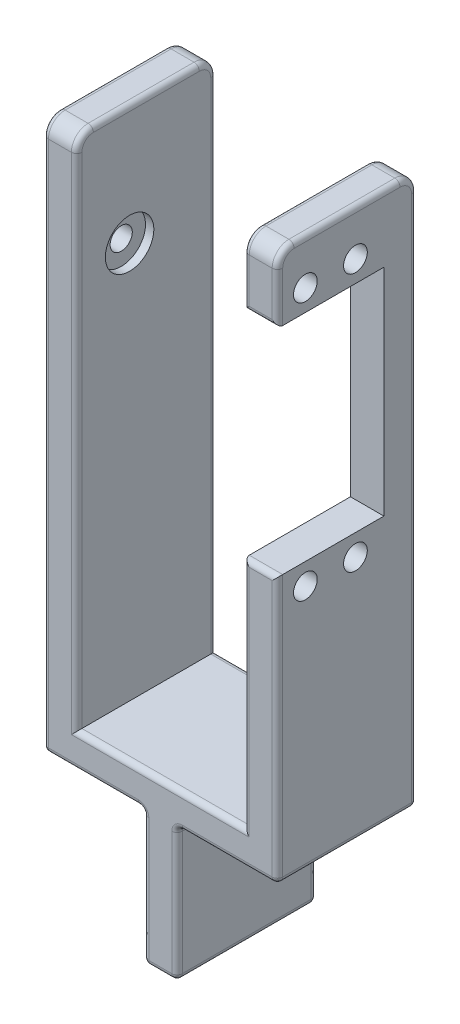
ISO-10303-21;
HEADER;
FILE_DESCRIPTION(('STEP AP214'),'2;1');
FILE_NAME('part.step','',(''),(''),'','','');
FILE_SCHEMA(('AUTOMOTIVE_DESIGN { 1 0 10303 214 1 1 1 1 }'));
ENDSEC;
DATA;
#1=APPLICATION_CONTEXT('core data for automotive mechanical design processes');
#2=APPLICATION_PROTOCOL_DEFINITION('international standard','automotive_design',2000,#1);
#3=PRODUCT_CONTEXT('',#1,'mechanical');
#4=PRODUCT('Part','Part','',(#3));
#5=PRODUCT_RELATED_PRODUCT_CATEGORY('part','',(#4));
#6=PRODUCT_DEFINITION_FORMATION('','',#4);
#7=PRODUCT_DEFINITION_CONTEXT('part definition',#1,'design');
#8=PRODUCT_DEFINITION('design','',#6,#7);
#9=PRODUCT_DEFINITION_SHAPE('','',#8);
#10=(LENGTH_UNIT() NAMED_UNIT(*) SI_UNIT(.MILLI.,.METRE.));
#11=(NAMED_UNIT(*) PLANE_ANGLE_UNIT() SI_UNIT($,.RADIAN.));
#12=(NAMED_UNIT(*) SI_UNIT($,.STERADIAN.) SOLID_ANGLE_UNIT());
#13=UNCERTAINTY_MEASURE_WITH_UNIT(LENGTH_MEASURE(1.E-05),#10,'distance_accuracy_value','');
#14=(GEOMETRIC_REPRESENTATION_CONTEXT(3) GLOBAL_UNCERTAINTY_ASSIGNED_CONTEXT((#13)) GLOBAL_UNIT_ASSIGNED_CONTEXT((#10,
#11,#12)) REPRESENTATION_CONTEXT('',''));
#15=CARTESIAN_POINT('',(0.,0.,0.));
#16=DIRECTION('',(0.,0.,1.));
#17=DIRECTION('',(1.,0.,0.));
#18=AXIS2_PLACEMENT_3D('',#15,#16,#17);
#19=CARTESIAN_POINT('',(-9.61960165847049,15.1912830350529,9.33028052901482));
#20=DIRECTION('',(-1.,0.,0.));
#21=DIRECTION('',(0.,0.,1.));
#22=AXIS2_PLACEMENT_3D('',#19,#20,#21);
#23=CYLINDRICAL_SURFACE('',#22,2.1);
#24=CARTESIAN_POINT('',(-19.6196016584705,15.1912830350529,9.33028052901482));
#25=DIRECTION('',(-1.,0.,0.));
#26=DIRECTION('',(0.,0.,1.));
#27=AXIS2_PLACEMENT_3D('',#24,#25,#26);
#28=CIRCLE('',#27,2.1);
#29=CARTESIAN_POINT('',(-19.6196016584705,15.1912830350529,11.4302805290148));
#30=VERTEX_POINT('',#29);
#31=EDGE_CURVE('E707',#30,#30,#28,.T.);
#32=ORIENTED_EDGE('',*,*,#31,.T.);
#33=EDGE_LOOP('',(#32));
#34=FACE_BOUND('',#33,.T.);
#35=CARTESIAN_POINT('',(-14.8571016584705,15.1912830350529,9.33028052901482));
#36=DIRECTION('',(1.,0.,0.));
#37=DIRECTION('',(0.,0.,-1.));
#38=AXIS2_PLACEMENT_3D('',#35,#36,#37);
#39=CIRCLE('',#38,2.1);
#40=CARTESIAN_POINT('',(-14.8571016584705,15.1912830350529,7.23028052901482));
#41=VERTEX_POINT('',#40);
#42=EDGE_CURVE('E51',#41,#41,#39,.F.);
#43=ORIENTED_EDGE('',*,*,#42,.F.);
#44=EDGE_LOOP('',(#43));
#45=FACE_BOUND('',#44,.T.);
#46=ADVANCED_FACE('F47',(#34,#45),#23,.F.);
#47=CARTESIAN_POINT('',(18.4803983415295,4.79128303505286,9.33028052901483));
#48=DIRECTION('',(1.,0.,0.));
#49=DIRECTION('',(0.,0.,-1.));
#50=AXIS2_PLACEMENT_3D('',#47,#48,#49);
#51=PLANE('',#50);
#52=DIRECTION('',(0.,0.,1.));
#53=VECTOR('',#52,1.);
#54=CARTESIAN_POINT('',(18.4803983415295,25.2412830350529,0.));
#55=LINE('',#54,#53);
#56=CARTESIAN_POINT('',(18.4803983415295,25.2412830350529,-0.81971947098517));
#57=VERTEX_POINT('',#56);
#58=CARTESIAN_POINT('',(18.4803983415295,25.2412830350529,18.3802805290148));
#59=VERTEX_POINT('',#58);
#60=EDGE_CURVE('E382',#57,#59,#55,.T.);
#61=ORIENTED_EDGE('',*,*,#60,.T.);
#62=DIRECTION('',(0.,1.,0.));
#63=VECTOR('',#62,1.);
#64=CARTESIAN_POINT('',(18.4803983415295,34.6662830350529,18.3802805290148));
#65=LINE('',#64,#63);
#66=CARTESIAN_POINT('',(18.4803983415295,34.6662830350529,18.3802805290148));
#67=VERTEX_POINT('',#66);
#68=EDGE_CURVE('E545',#59,#67,#65,.T.);
#69=ORIENTED_EDGE('',*,*,#68,.T.);
#70=CARTESIAN_POINT('',(18.4803983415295,34.6662830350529,16.2052805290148));
#71=DIRECTION('',(1.,0.,0.));
#72=DIRECTION('',(0.,0.,-1.));
#73=AXIS2_PLACEMENT_3D('',#70,#71,#72);
#74=CIRCLE('',#73,2.175);
#75=CARTESIAN_POINT('',(18.4803983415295,36.8412830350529,16.2052805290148));
#76=VERTEX_POINT('',#75);
#77=EDGE_CURVE('E542',#67,#76,#74,.F.);
#78=ORIENTED_EDGE('',*,*,#77,.T.);
#79=DIRECTION('',(0.,0.,-1.));
#80=VECTOR('',#79,1.);
#81=CARTESIAN_POINT('',(18.4803983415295,36.8412830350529,-3.89471947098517));
#82=LINE('',#81,#80);
#83=CARTESIAN_POINT('',(18.4803983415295,36.8412830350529,-3.89471947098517));
#84=VERTEX_POINT('',#83);
#85=EDGE_CURVE('E533',#76,#84,#82,.T.);
#86=ORIENTED_EDGE('',*,*,#85,.T.);
#87=CARTESIAN_POINT('',(18.4803983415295,34.6662830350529,-3.89471947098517));
#88=DIRECTION('',(1.,0.,0.));
#89=DIRECTION('',(0.,0.,-1.));
#90=AXIS2_PLACEMENT_3D('',#87,#88,#89);
#91=CIRCLE('',#90,2.175);
#92=CARTESIAN_POINT('',(18.4803983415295,34.6662830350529,-6.06971947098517));
#93=VERTEX_POINT('',#92);
#94=EDGE_CURVE('E536',#84,#93,#91,.F.);
#95=ORIENTED_EDGE('',*,*,#94,.T.);
#96=DIRECTION('',(0.,-1.,0.));
#97=VECTOR('',#96,1.);
#98=CARTESIAN_POINT('',(18.4803983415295,-60.0087169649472,-6.06971947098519));
#99=LINE('',#98,#97);
#100=CARTESIAN_POINT('',(18.4803983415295,-60.0087169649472,-6.06971947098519));
#101=VERTEX_POINT('',#100);
#102=EDGE_CURVE('E539',#93,#101,#99,.T.);
#103=ORIENTED_EDGE('',*,*,#102,.T.);
#104=DIRECTION('',(0.,0.,-1.));
#105=VECTOR('',#104,1.);
#106=CARTESIAN_POINT('',(18.4803983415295,-60.0087169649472,-7.0697194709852));
#107=LINE('',#106,#105);
#108=CARTESIAN_POINT('',(18.4803983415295,-60.0087169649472,18.3802805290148));
#109=VERTEX_POINT('',#108);
#110=EDGE_CURVE('E381',#109,#101,#107,.T.);
#111=ORIENTED_EDGE('',*,*,#110,.F.);
#112=DIRECTION('',(0.,1.,0.));
#113=VECTOR('',#112,1.);
#114=CARTESIAN_POINT('',(18.4803983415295,-15.6587169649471,18.3802805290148));
#115=LINE('',#114,#113);
#116=CARTESIAN_POINT('',(18.4803983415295,-15.6587169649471,18.3802805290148));
#117=VERTEX_POINT('',#116);
#118=EDGE_CURVE('E530',#109,#117,#115,.T.);
#119=ORIENTED_EDGE('',*,*,#118,.T.);
#120=DIRECTION('',(0.,0.,-1.));
#121=VECTOR('',#120,1.);
#122=CARTESIAN_POINT('',(18.4803983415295,-15.6587169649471,0.));
#123=LINE('',#122,#121);
#124=CARTESIAN_POINT('',(18.4803983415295,-15.6587169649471,-0.819719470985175));
#125=VERTEX_POINT('',#124);
#126=EDGE_CURVE('E375',#117,#125,#123,.T.);
#127=ORIENTED_EDGE('',*,*,#126,.T.);
#128=DIRECTION('',(0.,1.,0.));
#129=VECTOR('',#128,1.);
#130=CARTESIAN_POINT('',(18.4803983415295,0.,-0.819719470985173));
#131=LINE('',#130,#129);
#132=EDGE_CURVE('E350',#125,#57,#131,.T.);
#133=ORIENTED_EDGE('',*,*,#132,.T.);
#134=EDGE_LOOP('',(#61,#69,#78,#86,#95,#103,#111,#119,#127,#133));
#135=FACE_BOUND('',#134,.T.);
#136=CARTESIAN_POINT('',(18.4803983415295,29.2912830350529,14.0802805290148));
#137=DIRECTION('',(1.,0.,0.));
#138=DIRECTION('',(0.,0.,-1.));
#139=AXIS2_PLACEMENT_3D('',#136,#137,#138);
#140=CIRCLE('',#139,2.25);
#141=CARTESIAN_POINT('',(18.4803983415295,29.2912830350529,11.8302805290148));
#142=VERTEX_POINT('',#141);
#143=EDGE_CURVE('E1303',#142,#142,#140,.T.);
#144=ORIENTED_EDGE('',*,*,#143,.T.);
#145=EDGE_LOOP('',(#144));
#146=FACE_BOUND('',#145,.T.);
#147=CARTESIAN_POINT('',(18.4803983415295,29.2912830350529,4.58028052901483));
#148=DIRECTION('',(1.,0.,0.));
#149=DIRECTION('',(0.,0.,1.));
#150=AXIS2_PLACEMENT_3D('',#147,#148,#149);
#151=CIRCLE('',#150,2.25);
#152=CARTESIAN_POINT('',(18.4803983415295,29.2912830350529,6.83028052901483));
#153=VERTEX_POINT('',#152);
#154=EDGE_CURVE('E393',#153,#153,#151,.T.);
#155=ORIENTED_EDGE('',*,*,#154,.T.);
#156=EDGE_LOOP('',(#155));
#157=FACE_BOUND('',#156,.T.);
#158=CARTESIAN_POINT('',(18.4803983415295,-19.7087169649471,4.58028052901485));
#159=DIRECTION('',(1.,0.,0.));
#160=DIRECTION('',(0.,0.,-1.));
#161=AXIS2_PLACEMENT_3D('',#158,#159,#160);
#162=CIRCLE('',#161,2.25);
#163=CARTESIAN_POINT('',(18.4803983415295,-19.7087169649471,2.33028052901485));
#164=VERTEX_POINT('',#163);
#165=EDGE_CURVE('E2176',#164,#164,#162,.T.);
#166=ORIENTED_EDGE('',*,*,#165,.T.);
#167=EDGE_LOOP('',(#166));
#168=FACE_BOUND('',#167,.T.);
#169=CARTESIAN_POINT('',(18.4803983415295,-19.7087169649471,14.0802805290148));
#170=DIRECTION('',(1.,0.,0.));
#171=DIRECTION('',(0.,0.,1.));
#172=AXIS2_PLACEMENT_3D('',#169,#170,#171);
#173=CIRCLE('',#172,2.25);
#174=CARTESIAN_POINT('',(18.4803983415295,-19.7087169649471,16.3302805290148));
#175=VERTEX_POINT('',#174);
#176=EDGE_CURVE('E386',#175,#175,#173,.T.);
#177=ORIENTED_EDGE('',*,*,#176,.T.);
#178=EDGE_LOOP('',(#177));
#179=FACE_BOUND('',#178,.T.);
#180=ADVANCED_FACE('F968',(#135,#146,#157,#168,#179),#51,.F.);
#181=CARTESIAN_POINT('',(24.8303983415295,4.79128303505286,19.3802805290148));
#182=DIRECTION('',(0.,0.,1.));
#183=DIRECTION('',(1.,0.,0.));
#184=AXIS2_PLACEMENT_3D('',#181,#182,#183);
#185=PLANE('',#184);
#186=DIRECTION('',(1.,0.,0.));
#187=VECTOR('',#186,1.);
#188=CARTESIAN_POINT('',(24.8303983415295,34.6662830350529,19.3802805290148));
#189=LINE('',#188,#187);
#190=CARTESIAN_POINT('',(-14.2696016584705,34.6662830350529,19.3802805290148));
#191=VERTEX_POINT('',#190);
#192=CARTESIAN_POINT('',(-18.6196016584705,34.6662830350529,19.3802805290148));
#193=VERTEX_POINT('',#192);
#194=EDGE_CURVE('E427',#191,#193,#189,.F.);
#195=ORIENTED_EDGE('',*,*,#194,.T.);
#196=DIRECTION('',(0.,1.,0.));
#197=VECTOR('',#196,1.);
#198=CARTESIAN_POINT('',(-18.6196016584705,-66.3587169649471,19.3802805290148));
#199=LINE('',#198,#197);
#200=CARTESIAN_POINT('',(-18.6196016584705,-65.3587169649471,19.3802805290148));
#201=VERTEX_POINT('',#200);
#202=EDGE_CURVE('E492',#193,#201,#199,.F.);
#203=ORIENTED_EDGE('',*,*,#202,.T.);
#204=DIRECTION('',(-1.,0.,0.));
#205=VECTOR('',#204,1.);
#206=CARTESIAN_POINT('',(-0.569601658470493,-65.3587169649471,19.3802805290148));
#207=LINE('',#206,#205);
#208=CARTESIAN_POINT('',(-1.56960165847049,-65.3587169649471,19.3802805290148));
#209=VERTEX_POINT('',#208);
#210=EDGE_CURVE('E489',#201,#209,#207,.F.);
#211=ORIENTED_EDGE('',*,*,#210,.T.);
#212=CARTESIAN_POINT('',(-1.56960165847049,-67.3587169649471,19.3802805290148));
#213=DIRECTION('',(0.,0.,1.));
#214=DIRECTION('',(1.,0.,0.));
#215=AXIS2_PLACEMENT_3D('',#212,#213,#214);
#216=CIRCLE('',#215,2.);
#217=CARTESIAN_POINT('',(0.430398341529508,-67.3587169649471,19.3802805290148));
#218=VERTEX_POINT('',#217);
#219=EDGE_CURVE('E485',#218,#209,#216,.T.);
#220=ORIENTED_EDGE('',*,*,#219,.F.);
#221=DIRECTION('',(0.,1.,0.));
#222=VECTOR('',#221,1.);
#223=CARTESIAN_POINT('',(0.430398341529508,-91.7587169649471,19.3802805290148));
#224=LINE('',#223,#222);
#225=CARTESIAN_POINT('',(0.430398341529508,-90.7587169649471,19.3802805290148));
#226=VERTEX_POINT('',#225);
#227=EDGE_CURVE('E482',#218,#226,#224,.F.);
#228=ORIENTED_EDGE('',*,*,#227,.T.);
#229=DIRECTION('',(-1.,0.,0.));
#230=VECTOR('',#229,1.);
#231=CARTESIAN_POINT('',(5.78039834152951,-90.7587169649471,19.3802805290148));
#232=LINE('',#231,#230);
#233=CARTESIAN_POINT('',(4.78039834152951,-90.7587169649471,19.3802805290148));
#234=VERTEX_POINT('',#233);
#235=EDGE_CURVE('E476',#226,#234,#232,.F.);
#236=ORIENTED_EDGE('',*,*,#235,.T.);
#237=DIRECTION('',(0.,1.,0.));
#238=VECTOR('',#237,1.);
#239=CARTESIAN_POINT('',(4.78039834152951,-66.3587169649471,19.3802805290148));
#240=LINE('',#239,#238);
#241=CARTESIAN_POINT('',(4.78039834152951,-67.3587169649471,19.3802805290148));
#242=VERTEX_POINT('',#241);
#243=EDGE_CURVE('E473',#234,#242,#240,.T.);
#244=ORIENTED_EDGE('',*,*,#243,.T.);
#245=CARTESIAN_POINT('',(6.78039834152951,-67.3587169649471,19.3802805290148));
#246=DIRECTION('',(0.,0.,1.));
#247=DIRECTION('',(1.,0.,0.));
#248=AXIS2_PLACEMENT_3D('',#245,#246,#247);
#249=CIRCLE('',#248,2.);
#250=CARTESIAN_POINT('',(6.78039834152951,-65.3587169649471,19.3802805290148));
#251=VERTEX_POINT('',#250);
#252=EDGE_CURVE('E469',#251,#242,#249,.T.);
#253=ORIENTED_EDGE('',*,*,#252,.F.);
#254=DIRECTION('',(-1.,0.,0.));
#255=VECTOR('',#254,1.);
#256=CARTESIAN_POINT('',(24.8303983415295,-65.3587169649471,19.3802805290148));
#257=LINE('',#256,#255);
#258=CARTESIAN_POINT('',(23.8303983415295,-65.3587169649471,19.3802805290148));
#259=VERTEX_POINT('',#258);
#260=EDGE_CURVE('E460',#251,#259,#257,.F.);
#261=ORIENTED_EDGE('',*,*,#260,.T.);
#262=DIRECTION('',(0.,1.,0.));
#263=VECTOR('',#262,1.);
#264=CARTESIAN_POINT('',(23.8303983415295,4.79128303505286,19.3802805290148));
#265=LINE('',#264,#263);
#266=CARTESIAN_POINT('',(23.8303983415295,-16.6587169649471,19.3802805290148));
#267=VERTEX_POINT('',#266);
#268=EDGE_CURVE('E454',#259,#267,#265,.T.);
#269=ORIENTED_EDGE('',*,*,#268,.T.);
#270=DIRECTION('',(1.,0.,0.));
#271=VECTOR('',#270,1.);
#272=CARTESIAN_POINT('',(24.8303983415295,-16.6587169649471,19.3802805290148));
#273=LINE('',#272,#271);
#274=CARTESIAN_POINT('',(19.4803983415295,-16.6587169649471,19.3802805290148));
#275=VERTEX_POINT('',#274);
#276=EDGE_CURVE('E457',#267,#275,#273,.F.);
#277=ORIENTED_EDGE('',*,*,#276,.T.);
#278=DIRECTION('',(0.,1.,0.));
#279=VECTOR('',#278,1.);
#280=CARTESIAN_POINT('',(19.4803983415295,-60.0087169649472,19.3802805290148));
#281=LINE('',#280,#279);
#282=CARTESIAN_POINT('',(19.4803983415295,-61.0087169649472,19.3802805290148));
#283=VERTEX_POINT('',#282);
#284=EDGE_CURVE('E463',#275,#283,#281,.F.);
#285=ORIENTED_EDGE('',*,*,#284,.T.);
#286=DIRECTION('',(1.,0.,0.));
#287=VECTOR('',#286,1.);
#288=CARTESIAN_POINT('',(24.8303983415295,-61.0087169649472,19.3802805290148));
#289=LINE('',#288,#287);
#290=CARTESIAN_POINT('',(-14.2696016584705,-61.0087169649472,19.3802805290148));
#291=VERTEX_POINT('',#290);
#292=EDGE_CURVE('E466',#283,#291,#289,.F.);
#293=ORIENTED_EDGE('',*,*,#292,.T.);
#294=DIRECTION('',(0.,-1.,0.));
#295=VECTOR('',#294,1.);
#296=CARTESIAN_POINT('',(-14.2696016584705,34.6662830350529,19.3802805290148));
#297=LINE('',#296,#295);
#298=EDGE_CURVE('E479',#291,#191,#297,.F.);
#299=ORIENTED_EDGE('',*,*,#298,.T.);
#300=EDGE_LOOP('',(#195,#203,#211,#220,#228,#236,#244,#253,#261,#269,#277,#285,#293,#299));
#301=FACE_BOUND('',#300,.T.);
#302=ADVANCED_FACE('F974',(#301),#185,.T.);
#303=CARTESIAN_POINT('',(24.8303983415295,4.79128303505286,9.33028052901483));
#304=DIRECTION('',(1.,0.,0.));
#305=DIRECTION('',(0.,0.,-1.));
#306=AXIS2_PLACEMENT_3D('',#303,#304,#305);
#307=PLANE('',#306);
#308=DIRECTION('',(0.,0.,1.));
#309=VECTOR('',#308,1.);
#310=CARTESIAN_POINT('',(24.8303983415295,-15.6587169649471,0.));
#311=LINE('',#310,#309);
#312=CARTESIAN_POINT('',(24.8303983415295,-15.6587169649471,-0.819719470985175));
#313=VERTEX_POINT('',#312);
#314=CARTESIAN_POINT('',(24.8303983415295,-15.6587169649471,18.3802805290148));
#315=VERTEX_POINT('',#314);
#316=EDGE_CURVE('E357',#313,#315,#311,.T.);
#317=ORIENTED_EDGE('',*,*,#316,.T.);
#318=DIRECTION('',(0.,1.,0.));
#319=VECTOR('',#318,1.);
#320=CARTESIAN_POINT('',(24.8303983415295,4.79128303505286,18.3802805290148));
#321=LINE('',#320,#319);
#322=CARTESIAN_POINT('',(24.8303983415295,-65.3587169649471,18.3802805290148));
#323=VERTEX_POINT('',#322);
#324=EDGE_CURVE('E625',#315,#323,#321,.F.);
#325=ORIENTED_EDGE('',*,*,#324,.T.);
#326=DIRECTION('',(0.,0.,1.));
#327=VECTOR('',#326,1.);
#328=CARTESIAN_POINT('',(24.8303983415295,-65.3587169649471,-7.0697194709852));
#329=LINE('',#328,#327);
#330=CARTESIAN_POINT('',(24.8303983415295,-65.3587169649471,-6.06971947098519));
#331=VERTEX_POINT('',#330);
#332=EDGE_CURVE('E610',#323,#331,#329,.F.);
#333=ORIENTED_EDGE('',*,*,#332,.T.);
#334=DIRECTION('',(0.,-1.,0.));
#335=VECTOR('',#334,1.);
#336=CARTESIAN_POINT('',(24.8303983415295,4.79128303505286,-6.06971947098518));
#337=LINE('',#336,#335);
#338=CARTESIAN_POINT('',(24.8303983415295,34.6662830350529,-6.06971947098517));
#339=VERTEX_POINT('',#338);
#340=EDGE_CURVE('E607',#331,#339,#337,.F.);
#341=ORIENTED_EDGE('',*,*,#340,.T.);
#342=CARTESIAN_POINT('',(24.8303983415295,34.6662830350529,-3.89471947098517));
#343=DIRECTION('',(1.,0.,0.));
#344=DIRECTION('',(0.,0.,-1.));
#345=AXIS2_PLACEMENT_3D('',#342,#343,#344);
#346=CIRCLE('',#345,2.175);
#347=CARTESIAN_POINT('',(24.8303983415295,36.8412830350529,-3.89471947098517));
#348=VERTEX_POINT('',#347);
#349=EDGE_CURVE('E613',#339,#348,#346,.T.);
#350=ORIENTED_EDGE('',*,*,#349,.T.);
#351=DIRECTION('',(0.,0.,-1.));
#352=VECTOR('',#351,1.);
#353=CARTESIAN_POINT('',(24.8303983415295,36.8412830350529,9.33028052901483));
#354=LINE('',#353,#352);
#355=CARTESIAN_POINT('',(24.8303983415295,36.8412830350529,16.2052805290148));
#356=VERTEX_POINT('',#355);
#357=EDGE_CURVE('E616',#348,#356,#354,.F.);
#358=ORIENTED_EDGE('',*,*,#357,.T.);
#359=CARTESIAN_POINT('',(24.8303983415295,34.6662830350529,16.2052805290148));
#360=DIRECTION('',(1.,0.,0.));
#361=DIRECTION('',(0.,0.,-1.));
#362=AXIS2_PLACEMENT_3D('',#359,#360,#361);
#363=CIRCLE('',#362,2.175);
#364=CARTESIAN_POINT('',(24.8303983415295,34.6662830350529,18.3802805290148));
#365=VERTEX_POINT('',#364);
#366=EDGE_CURVE('E619',#356,#365,#363,.T.);
#367=ORIENTED_EDGE('',*,*,#366,.T.);
#368=DIRECTION('',(0.,1.,0.));
#369=VECTOR('',#368,1.);
#370=CARTESIAN_POINT('',(24.8303983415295,4.79128303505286,18.3802805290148));
#371=LINE('',#370,#369);
#372=CARTESIAN_POINT('',(24.8303983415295,25.2412830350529,18.3802805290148));
#373=VERTEX_POINT('',#372);
#374=EDGE_CURVE('E622',#365,#373,#371,.F.);
#375=ORIENTED_EDGE('',*,*,#374,.T.);
#376=DIRECTION('',(0.,0.,-1.));
#377=VECTOR('',#376,1.);
#378=CARTESIAN_POINT('',(24.8303983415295,25.2412830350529,0.));
#379=LINE('',#378,#377);
#380=CARTESIAN_POINT('',(24.8303983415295,25.2412830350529,-0.81971947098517));
#381=VERTEX_POINT('',#380);
#382=EDGE_CURVE('E364',#373,#381,#379,.T.);
#383=ORIENTED_EDGE('',*,*,#382,.T.);
#384=DIRECTION('',(0.,-1.,0.));
#385=VECTOR('',#384,1.);
#386=CARTESIAN_POINT('',(24.8303983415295,0.,-0.819719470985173));
#387=LINE('',#386,#385);
#388=EDGE_CURVE('E348',#381,#313,#387,.T.);
#389=ORIENTED_EDGE('',*,*,#388,.T.);
#390=EDGE_LOOP('',(#317,#325,#333,#341,#350,#358,#367,#375,#383,#389));
#391=FACE_BOUND('',#390,.T.);
#392=CARTESIAN_POINT('',(24.8303983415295,-19.7087169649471,14.0802805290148));
#393=DIRECTION('',(1.,0.,0.));
#394=DIRECTION('',(0.,0.,1.));
#395=AXIS2_PLACEMENT_3D('',#392,#393,#394);
#396=CIRCLE('',#395,2.25);
#397=CARTESIAN_POINT('',(24.8303983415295,-19.7087169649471,16.3302805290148));
#398=VERTEX_POINT('',#397);
#399=EDGE_CURVE('E2180',#398,#398,#396,.T.);
#400=ORIENTED_EDGE('',*,*,#399,.F.);
#401=EDGE_LOOP('',(#400));
#402=FACE_BOUND('',#401,.T.);
#403=CARTESIAN_POINT('',(24.8303983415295,-19.7087169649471,4.58028052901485));
#404=DIRECTION('',(1.,0.,0.));
#405=DIRECTION('',(0.,0.,-1.));
#406=AXIS2_PLACEMENT_3D('',#403,#404,#405);
#407=CIRCLE('',#406,2.25);
#408=CARTESIAN_POINT('',(24.8303983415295,-19.7087169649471,2.33028052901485));
#409=VERTEX_POINT('',#408);
#410=EDGE_CURVE('E2187',#409,#409,#407,.T.);
#411=ORIENTED_EDGE('',*,*,#410,.F.);
#412=EDGE_LOOP('',(#411));
#413=FACE_BOUND('',#412,.T.);
#414=CARTESIAN_POINT('',(24.8303983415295,29.2912830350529,4.58028052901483));
#415=DIRECTION('',(1.,0.,0.));
#416=DIRECTION('',(0.,0.,1.));
#417=AXIS2_PLACEMENT_3D('',#414,#415,#416);
#418=CIRCLE('',#417,2.25);
#419=CARTESIAN_POINT('',(24.8303983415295,29.2912830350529,6.83028052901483));
#420=VERTEX_POINT('',#419);
#421=EDGE_CURVE('E387',#420,#420,#418,.T.);
#422=ORIENTED_EDGE('',*,*,#421,.F.);
#423=EDGE_LOOP('',(#422));
#424=FACE_BOUND('',#423,.T.);
#425=CARTESIAN_POINT('',(24.8303983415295,29.2912830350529,14.0802805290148));
#426=DIRECTION('',(1.,0.,0.));
#427=DIRECTION('',(0.,0.,-1.));
#428=AXIS2_PLACEMENT_3D('',#425,#426,#427);
#429=CIRCLE('',#428,2.25);
#430=CARTESIAN_POINT('',(24.8303983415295,29.2912830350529,11.8302805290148));
#431=VERTEX_POINT('',#430);
#432=EDGE_CURVE('E392',#431,#431,#429,.T.);
#433=ORIENTED_EDGE('',*,*,#432,.F.);
#434=EDGE_LOOP('',(#433));
#435=FACE_BOUND('',#434,.T.);
#436=ADVANCED_FACE('F366',(#391,#402,#413,#424,#435),#307,.T.);
#437=CARTESIAN_POINT('',(24.8303983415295,4.79128303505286,19.3802805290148));
#438=DIRECTION('',(0.,0.,1.));
#439=DIRECTION('',(0.,-1.,0.));
#440=AXIS2_PLACEMENT_3D('',#437,#438,#439);
#441=PLANE('',#440);
#442=DIRECTION('',(-1.,0.,0.));
#443=VECTOR('',#442,1.);
#444=CARTESIAN_POINT('',(24.8303983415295,34.6662830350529,19.3802805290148));
#445=LINE('',#444,#443);
#446=CARTESIAN_POINT('',(23.8303983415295,34.6662830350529,19.3802805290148));
#447=VERTEX_POINT('',#446);
#448=CARTESIAN_POINT('',(19.4803983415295,34.6662830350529,19.3802805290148));
#449=VERTEX_POINT('',#448);
#450=EDGE_CURVE('E422',#447,#449,#445,.T.);
#451=ORIENTED_EDGE('',*,*,#450,.T.);
#452=DIRECTION('',(0.,1.,0.));
#453=VECTOR('',#452,1.);
#454=CARTESIAN_POINT('',(19.4803983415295,25.2412830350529,19.3802805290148));
#455=LINE('',#454,#453);
#456=CARTESIAN_POINT('',(19.4803983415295,26.2412830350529,19.3802805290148));
#457=VERTEX_POINT('',#456);
#458=EDGE_CURVE('E554',#449,#457,#455,.F.);
#459=ORIENTED_EDGE('',*,*,#458,.T.);
#460=DIRECTION('',(1.,0.,0.));
#461=VECTOR('',#460,1.);
#462=CARTESIAN_POINT('',(24.8303983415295,26.2412830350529,19.3802805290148));
#463=LINE('',#462,#461);
#464=CARTESIAN_POINT('',(23.8303983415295,26.2412830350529,19.3802805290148));
#465=VERTEX_POINT('',#464);
#466=EDGE_CURVE('E548',#457,#465,#463,.T.);
#467=ORIENTED_EDGE('',*,*,#466,.T.);
#468=DIRECTION('',(0.,1.,0.));
#469=VECTOR('',#468,1.);
#470=CARTESIAN_POINT('',(23.8303983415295,4.79128303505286,19.3802805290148));
#471=LINE('',#470,#469);
#472=EDGE_CURVE('E551',#465,#447,#471,.T.);
#473=ORIENTED_EDGE('',*,*,#472,.T.);
#474=EDGE_LOOP('',(#451,#459,#467,#473));
#475=FACE_BOUND('',#474,.T.);
#476=ADVANCED_FACE('F1009',(#475),#441,.T.);
#477=CARTESIAN_POINT('',(0.,-66.3587169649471,0.));
#478=DIRECTION('',(0.,1.,0.));
#479=DIRECTION('',(0.,0.,1.));
#480=AXIS2_PLACEMENT_3D('',#477,#478,#479);
#481=PLANE('',#480);
#482=DIRECTION('',(0.,0.,-1.));
#483=VECTOR('',#482,1.);
#484=CARTESIAN_POINT('',(-18.6196016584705,-66.3587169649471,0.));
#485=LINE('',#484,#483);
#486=CARTESIAN_POINT('',(-18.6196016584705,-66.3587169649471,18.3802805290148));
#487=VERTEX_POINT('',#486);
#488=CARTESIAN_POINT('',(-18.6196016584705,-66.3587169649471,-6.06971947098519));
#489=VERTEX_POINT('',#488);
#490=EDGE_CURVE('E666',#487,#489,#485,.T.);
#491=ORIENTED_EDGE('',*,*,#490,.T.);
#492=DIRECTION('',(1.,0.,0.));
#493=VECTOR('',#492,1.);
#494=CARTESIAN_POINT('',(-0.569601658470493,-66.3587169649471,-6.06971947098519));
#495=LINE('',#494,#493);
#496=CARTESIAN_POINT('',(-1.56960165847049,-66.3587169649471,-6.06971947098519));
#497=VERTEX_POINT('',#496);
#498=EDGE_CURVE('E669',#489,#497,#495,.T.);
#499=ORIENTED_EDGE('',*,*,#498,.T.);
#500=DIRECTION('',(0.,0.,-1.));
#501=VECTOR('',#500,1.);
#502=CARTESIAN_POINT('',(-1.56960165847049,-66.3587169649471,19.3802805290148));
#503=LINE('',#502,#501);
#504=CARTESIAN_POINT('',(-1.56960165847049,-66.3587169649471,18.3802805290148));
#505=VERTEX_POINT('',#504);
#506=EDGE_CURVE('E660',#497,#505,#503,.F.);
#507=ORIENTED_EDGE('',*,*,#506,.T.);
#508=DIRECTION('',(-1.,0.,0.));
#509=VECTOR('',#508,1.);
#510=CARTESIAN_POINT('',(-19.6196016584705,-66.3587169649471,18.3802805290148));
#511=LINE('',#510,#509);
#512=EDGE_CURVE('E663',#505,#487,#511,.T.);
#513=ORIENTED_EDGE('',*,*,#512,.T.);
#514=EDGE_LOOP('',(#491,#499,#507,#513));
#515=FACE_BOUND('',#514,.T.);
#516=ADVANCED_FACE('F1005',(#515),#481,.F.);
#517=DIRECTION('',(0.,0.,1.));
#518=VECTOR('',#517,1.);
#519=CARTESIAN_POINT('',(23.8303983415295,-66.3587169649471,19.3802805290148));
#520=LINE('',#519,#518);
#521=CARTESIAN_POINT('',(23.8303983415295,-66.3587169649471,-6.06971947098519));
#522=VERTEX_POINT('',#521);
#523=CARTESIAN_POINT('',(23.8303983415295,-66.3587169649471,18.3802805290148));
#524=VERTEX_POINT('',#523);
#525=EDGE_CURVE('E640',#522,#524,#520,.T.);
#526=ORIENTED_EDGE('',*,*,#525,.T.);
#527=DIRECTION('',(-1.,0.,0.));
#528=VECTOR('',#527,1.);
#529=CARTESIAN_POINT('',(5.78039834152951,-66.3587169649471,18.3802805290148));
#530=LINE('',#529,#528);
#531=CARTESIAN_POINT('',(6.78039834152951,-66.3587169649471,18.3802805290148));
#532=VERTEX_POINT('',#531);
#533=EDGE_CURVE('E643',#524,#532,#530,.T.);
#534=ORIENTED_EDGE('',*,*,#533,.T.);
#535=DIRECTION('',(0.,0.,1.));
#536=VECTOR('',#535,1.);
#537=CARTESIAN_POINT('',(6.78039834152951,-66.3587169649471,-7.0697194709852));
#538=LINE('',#537,#536);
#539=CARTESIAN_POINT('',(6.78039834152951,-66.3587169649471,-6.06971947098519));
#540=VERTEX_POINT('',#539);
#541=EDGE_CURVE('E634',#532,#540,#538,.F.);
#542=ORIENTED_EDGE('',*,*,#541,.T.);
#543=DIRECTION('',(1.,0.,0.));
#544=VECTOR('',#543,1.);
#545=CARTESIAN_POINT('',(24.8303983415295,-66.3587169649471,-6.06971947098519));
#546=LINE('',#545,#544);
#547=EDGE_CURVE('E637',#540,#522,#546,.T.);
#548=ORIENTED_EDGE('',*,*,#547,.T.);
#549=EDGE_LOOP('',(#526,#534,#542,#548));
#550=FACE_BOUND('',#549,.T.);
#551=ADVANCED_FACE('F1008',(#550),#481,.F.);
#552=CARTESIAN_POINT('',(24.8303983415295,4.79128303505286,-7.06971947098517));
#553=DIRECTION('',(0.,0.,-1.));
#554=DIRECTION('',(0.,1.,0.));
#555=AXIS2_PLACEMENT_3D('',#552,#553,#554);
#556=PLANE('',#555);
#557=DIRECTION('',(-1.,0.,0.));
#558=VECTOR('',#557,1.);
#559=CARTESIAN_POINT('',(24.8303983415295,-61.0087169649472,-7.06971947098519));
#560=LINE('',#559,#558);
#561=CARTESIAN_POINT('',(-14.2696016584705,-61.0087169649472,-7.06971947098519));
#562=VERTEX_POINT('',#561);
#563=CARTESIAN_POINT('',(19.4803983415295,-61.0087169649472,-7.06971947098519));
#564=VERTEX_POINT('',#563);
#565=EDGE_CURVE('E592',#562,#564,#560,.F.);
#566=ORIENTED_EDGE('',*,*,#565,.T.);
#567=DIRECTION('',(0.,-1.,0.));
#568=VECTOR('',#567,1.);
#569=CARTESIAN_POINT('',(19.4803983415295,34.6662830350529,-7.06971947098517));
#570=LINE('',#569,#568);
#571=CARTESIAN_POINT('',(19.4803983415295,34.6662830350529,-7.06971947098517));
#572=VERTEX_POINT('',#571);
#573=EDGE_CURVE('E598',#564,#572,#570,.F.);
#574=ORIENTED_EDGE('',*,*,#573,.T.);
#575=DIRECTION('',(-1.,0.,0.));
#576=VECTOR('',#575,1.);
#577=CARTESIAN_POINT('',(24.8303983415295,34.6662830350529,-7.06971947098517));
#578=LINE('',#577,#576);
#579=CARTESIAN_POINT('',(23.8303983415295,34.6662830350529,-7.06971947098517));
#580=VERTEX_POINT('',#579);
#581=EDGE_CURVE('E1307',#572,#580,#578,.F.);
#582=ORIENTED_EDGE('',*,*,#581,.T.);
#583=DIRECTION('',(0.,-1.,0.));
#584=VECTOR('',#583,1.);
#585=CARTESIAN_POINT('',(23.8303983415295,4.79128303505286,-7.06971947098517));
#586=LINE('',#585,#584);
#587=CARTESIAN_POINT('',(23.8303983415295,-65.3587169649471,-7.06971947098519));
#588=VERTEX_POINT('',#587);
#589=EDGE_CURVE('E563',#580,#588,#586,.T.);
#590=ORIENTED_EDGE('',*,*,#589,.T.);
#591=DIRECTION('',(1.,0.,0.));
#592=VECTOR('',#591,1.);
#593=CARTESIAN_POINT('',(5.78039834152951,-65.3587169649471,-7.06971947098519));
#594=LINE('',#593,#592);
#595=CARTESIAN_POINT('',(6.78039834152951,-65.3587169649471,-7.06971947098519));
#596=VERTEX_POINT('',#595);
#597=EDGE_CURVE('E566',#588,#596,#594,.F.);
#598=ORIENTED_EDGE('',*,*,#597,.T.);
#599=CARTESIAN_POINT('',(6.78039834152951,-67.3587169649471,-7.06971947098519));
#600=DIRECTION('',(0.,0.,-1.));
#601=DIRECTION('',(0.,1.,0.));
#602=AXIS2_PLACEMENT_3D('',#599,#600,#601);
#603=CIRCLE('',#602,2.);
#604=CARTESIAN_POINT('',(4.78039834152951,-67.3587169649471,-7.06971947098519));
#605=VERTEX_POINT('',#604);
#606=EDGE_CURVE('E569',#605,#596,#603,.T.);
#607=ORIENTED_EDGE('',*,*,#606,.F.);
#608=DIRECTION('',(0.,1.,0.));
#609=VECTOR('',#608,1.);
#610=CARTESIAN_POINT('',(4.78039834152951,-91.7587169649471,-7.0697194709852));
#611=LINE('',#610,#609);
#612=CARTESIAN_POINT('',(4.78039834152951,-90.7587169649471,-7.0697194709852));
#613=VERTEX_POINT('',#612);
#614=EDGE_CURVE('E573',#605,#613,#611,.F.);
#615=ORIENTED_EDGE('',*,*,#614,.T.);
#616=DIRECTION('',(1.,0.,0.));
#617=VECTOR('',#616,1.);
#618=CARTESIAN_POINT('',(-0.569601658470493,-90.7587169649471,-7.0697194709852));
#619=LINE('',#618,#617);
#620=CARTESIAN_POINT('',(0.430398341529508,-90.7587169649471,-7.0697194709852));
#621=VERTEX_POINT('',#620);
#622=EDGE_CURVE('E576',#613,#621,#619,.F.);
#623=ORIENTED_EDGE('',*,*,#622,.T.);
#624=DIRECTION('',(0.,1.,0.));
#625=VECTOR('',#624,1.);
#626=CARTESIAN_POINT('',(0.430398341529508,-66.3587169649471,-7.06971947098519));
#627=LINE('',#626,#625);
#628=CARTESIAN_POINT('',(0.430398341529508,-67.3587169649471,-7.06971947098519));
#629=VERTEX_POINT('',#628);
#630=EDGE_CURVE('E579',#621,#629,#627,.T.);
#631=ORIENTED_EDGE('',*,*,#630,.T.);
#632=CARTESIAN_POINT('',(-1.56960165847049,-67.3587169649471,-7.06971947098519));
#633=DIRECTION('',(0.,0.,-1.));
#634=DIRECTION('',(0.,1.,0.));
#635=AXIS2_PLACEMENT_3D('',#632,#633,#634);
#636=CIRCLE('',#635,2.);
#637=CARTESIAN_POINT('',(-1.56960165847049,-65.3587169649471,-7.06971947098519));
#638=VERTEX_POINT('',#637);
#639=EDGE_CURVE('E582',#638,#629,#636,.T.);
#640=ORIENTED_EDGE('',*,*,#639,.F.);
#641=DIRECTION('',(1.,0.,0.));
#642=VECTOR('',#641,1.);
#643=CARTESIAN_POINT('',(-19.6196016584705,-65.3587169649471,-7.06971947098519));
#644=LINE('',#643,#642);
#645=CARTESIAN_POINT('',(-18.6196016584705,-65.3587169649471,-7.06971947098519));
#646=VERTEX_POINT('',#645);
#647=EDGE_CURVE('E586',#638,#646,#644,.F.);
#648=ORIENTED_EDGE('',*,*,#647,.T.);
#649=DIRECTION('',(0.,-1.,0.));
#650=VECTOR('',#649,1.);
#651=CARTESIAN_POINT('',(-18.6196016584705,34.6662830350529,-7.06971947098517));
#652=LINE('',#651,#650);
#653=CARTESIAN_POINT('',(-18.6196016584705,34.6662830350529,-7.06971947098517));
#654=VERTEX_POINT('',#653);
#655=EDGE_CURVE('E589',#646,#654,#652,.F.);
#656=ORIENTED_EDGE('',*,*,#655,.T.);
#657=DIRECTION('',(-1.,0.,0.));
#658=VECTOR('',#657,1.);
#659=CARTESIAN_POINT('',(24.8303983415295,34.6662830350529,-7.06971947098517));
#660=LINE('',#659,#658);
#661=CARTESIAN_POINT('',(-14.2696016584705,34.6662830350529,-7.06971947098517));
#662=VERTEX_POINT('',#661);
#663=EDGE_CURVE('E431',#654,#662,#660,.F.);
#664=ORIENTED_EDGE('',*,*,#663,.T.);
#665=DIRECTION('',(0.,-1.,0.));
#666=VECTOR('',#665,1.);
#667=CARTESIAN_POINT('',(-14.2696016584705,-60.0087169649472,-7.06971947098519));
#668=LINE('',#667,#666);
#669=EDGE_CURVE('E595',#662,#562,#668,.T.);
#670=ORIENTED_EDGE('',*,*,#669,.T.);
#671=EDGE_LOOP('',(#566,#574,#582,#590,#598,#607,#615,#623,#631,#640,#648,#656,#664,#670));
#672=FACE_BOUND('',#671,.T.);
#673=ADVANCED_FACE('F1050',(#672),#556,.T.);
#674=CARTESIAN_POINT('',(24.8303983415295,37.8412830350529,9.33028052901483));
#675=DIRECTION('',(0.,1.,0.));
#676=DIRECTION('',(0.,0.,1.));
#677=AXIS2_PLACEMENT_3D('',#674,#675,#676);
#678=PLANE('',#677);
#679=DIRECTION('',(-1.,0.,0.));
#680=VECTOR('',#679,1.);
#681=CARTESIAN_POINT('',(24.8303983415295,37.8412830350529,16.2052805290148));
#682=LINE('',#681,#680);
#683=CARTESIAN_POINT('',(19.4803983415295,37.8412830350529,16.2052805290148));
#684=VERTEX_POINT('',#683);
#685=CARTESIAN_POINT('',(23.8303983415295,37.8412830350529,16.2052805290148));
#686=VERTEX_POINT('',#685);
#687=EDGE_CURVE('E1295',#684,#686,#682,.F.);
#688=ORIENTED_EDGE('',*,*,#687,.T.);
#689=DIRECTION('',(0.,0.,-1.));
#690=VECTOR('',#689,1.);
#691=CARTESIAN_POINT('',(23.8303983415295,37.8412830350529,9.33028052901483));
#692=LINE('',#691,#690);
#693=CARTESIAN_POINT('',(23.8303983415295,37.8412830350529,-3.89471947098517));
#694=VERTEX_POINT('',#693);
#695=EDGE_CURVE('E631',#686,#694,#692,.T.);
#696=ORIENTED_EDGE('',*,*,#695,.T.);
#697=DIRECTION('',(-1.,0.,0.));
#698=VECTOR('',#697,1.);
#699=CARTESIAN_POINT('',(24.8303983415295,37.8412830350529,-3.89471947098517));
#700=LINE('',#699,#698);
#701=CARTESIAN_POINT('',(19.4803983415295,37.8412830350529,-3.89471947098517));
#702=VERTEX_POINT('',#701);
#703=EDGE_CURVE('E1298',#694,#702,#700,.T.);
#704=ORIENTED_EDGE('',*,*,#703,.T.);
#705=DIRECTION('',(0.,0.,-1.));
#706=VECTOR('',#705,1.);
#707=CARTESIAN_POINT('',(19.4803983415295,37.8412830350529,16.2052805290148));
#708=LINE('',#707,#706);
#709=EDGE_CURVE('E628',#702,#684,#708,.F.);
#710=ORIENTED_EDGE('',*,*,#709,.T.);
#711=EDGE_LOOP('',(#688,#696,#704,#710));
#712=FACE_BOUND('',#711,.T.);
#713=ADVANCED_FACE('F1041',(#712),#678,.T.);
#714=CARTESIAN_POINT('',(18.4803983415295,29.2912830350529,14.0802805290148));
#715=DIRECTION('',(1.,0.,0.));
#716=DIRECTION('',(0.,0.,-1.));
#717=AXIS2_PLACEMENT_3D('',#714,#715,#716);
#718=CYLINDRICAL_SURFACE('',#717,2.25);
#719=ORIENTED_EDGE('',*,*,#143,.F.);
#720=EDGE_LOOP('',(#719));
#721=FACE_BOUND('',#720,.T.);
#722=ORIENTED_EDGE('',*,*,#432,.T.);
#723=EDGE_LOOP('',(#722));
#724=FACE_BOUND('',#723,.T.);
#725=ADVANCED_FACE('F1029',(#721,#724),#718,.F.);
#726=CARTESIAN_POINT('',(18.4803983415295,29.2912830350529,4.58028052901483));
#727=DIRECTION('',(1.,0.,0.));
#728=DIRECTION('',(0.,0.,-1.));
#729=AXIS2_PLACEMENT_3D('',#726,#727,#728);
#730=CYLINDRICAL_SURFACE('',#729,2.25);
#731=ORIENTED_EDGE('',*,*,#154,.F.);
#732=EDGE_LOOP('',(#731));
#733=FACE_BOUND('',#732,.T.);
#734=ORIENTED_EDGE('',*,*,#421,.T.);
#735=EDGE_LOOP('',(#734));
#736=FACE_BOUND('',#735,.T.);
#737=ADVANCED_FACE('F1025',(#733,#736),#730,.F.);
#738=CARTESIAN_POINT('',(18.4803983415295,-19.7087169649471,4.58028052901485));
#739=DIRECTION('',(1.,0.,0.));
#740=DIRECTION('',(0.,0.,-1.));
#741=AXIS2_PLACEMENT_3D('',#738,#739,#740);
#742=CYLINDRICAL_SURFACE('',#741,2.25);
#743=ORIENTED_EDGE('',*,*,#165,.F.);
#744=EDGE_LOOP('',(#743));
#745=FACE_BOUND('',#744,.T.);
#746=ORIENTED_EDGE('',*,*,#410,.T.);
#747=EDGE_LOOP('',(#746));
#748=FACE_BOUND('',#747,.T.);
#749=ADVANCED_FACE('F1028',(#745,#748),#742,.F.);
#750=CARTESIAN_POINT('',(18.4803983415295,-19.7087169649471,14.0802805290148));
#751=DIRECTION('',(1.,0.,0.));
#752=DIRECTION('',(0.,0.,-1.));
#753=AXIS2_PLACEMENT_3D('',#750,#751,#752);
#754=CYLINDRICAL_SURFACE('',#753,2.25);
#755=ORIENTED_EDGE('',*,*,#176,.F.);
#756=EDGE_LOOP('',(#755));
#757=FACE_BOUND('',#756,.T.);
#758=ORIENTED_EDGE('',*,*,#399,.T.);
#759=EDGE_LOOP('',(#758));
#760=FACE_BOUND('',#759,.T.);
#761=ADVANCED_FACE('F1033',(#757,#760),#754,.F.);
#762=CARTESIAN_POINT('',(24.8303983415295,34.6662830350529,-3.89471947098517));
#763=DIRECTION('',(-1.,0.,0.));
#764=DIRECTION('',(0.,0.,1.));
#765=AXIS2_PLACEMENT_3D('',#762,#763,#764);
#766=CYLINDRICAL_SURFACE('',#765,3.175);
#767=ORIENTED_EDGE('',*,*,#581,.F.);
#768=CARTESIAN_POINT('',(19.4803983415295,34.6662830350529,-3.89471947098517));
#769=DIRECTION('',(1.,0.,0.));
#770=DIRECTION('',(0.,0.,-1.));
#771=AXIS2_PLACEMENT_3D('',#768,#769,#770);
#772=CIRCLE('',#771,3.175);
#773=EDGE_CURVE('E604',#572,#702,#772,.T.);
#774=ORIENTED_EDGE('',*,*,#773,.T.);
#775=ORIENTED_EDGE('',*,*,#703,.F.);
#776=CARTESIAN_POINT('',(23.8303983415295,34.6662830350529,-3.89471947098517));
#777=DIRECTION('',(1.,0.,0.));
#778=DIRECTION('',(0.,0.,-1.));
#779=AXIS2_PLACEMENT_3D('',#776,#777,#778);
#780=CIRCLE('',#779,3.175);
#781=EDGE_CURVE('E601',#694,#580,#780,.F.);
#782=ORIENTED_EDGE('',*,*,#781,.T.);
#783=EDGE_LOOP('',(#767,#774,#775,#782));
#784=FACE_BOUND('',#783,.T.);
#785=ADVANCED_FACE('F1037',(#784),#766,.T.);
#786=CARTESIAN_POINT('',(24.8303983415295,34.6662830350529,16.2052805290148));
#787=DIRECTION('',(-1.,0.,0.));
#788=DIRECTION('',(0.,0.,1.));
#789=AXIS2_PLACEMENT_3D('',#786,#787,#788);
#790=CYLINDRICAL_SURFACE('',#789,3.175);
#791=ORIENTED_EDGE('',*,*,#687,.F.);
#792=CARTESIAN_POINT('',(19.4803983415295,34.6662830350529,16.2052805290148));
#793=DIRECTION('',(1.,0.,0.));
#794=DIRECTION('',(0.,0.,-1.));
#795=AXIS2_PLACEMENT_3D('',#792,#793,#794);
#796=CIRCLE('',#795,3.175);
#797=EDGE_CURVE('E560',#684,#449,#796,.T.);
#798=ORIENTED_EDGE('',*,*,#797,.T.);
#799=ORIENTED_EDGE('',*,*,#450,.F.);
#800=CARTESIAN_POINT('',(23.8303983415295,34.6662830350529,16.2052805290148));
#801=DIRECTION('',(1.,0.,0.));
#802=DIRECTION('',(0.,0.,-1.));
#803=AXIS2_PLACEMENT_3D('',#800,#801,#802);
#804=CIRCLE('',#803,3.175);
#805=EDGE_CURVE('E557',#447,#686,#804,.F.);
#806=ORIENTED_EDGE('',*,*,#805,.T.);
#807=EDGE_LOOP('',(#791,#798,#799,#806));
#808=FACE_BOUND('',#807,.T.);
#809=ADVANCED_FACE('F1023',(#808),#790,.T.);
#810=CARTESIAN_POINT('',(-19.6196016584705,4.79128303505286,9.33028052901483));
#811=DIRECTION('',(1.,0.,0.));
#812=DIRECTION('',(0.,0.,-1.));
#813=AXIS2_PLACEMENT_3D('',#810,#811,#812);
#814=PLANE('',#813);
#815=ORIENTED_EDGE('',*,*,#31,.F.);
#816=EDGE_LOOP('',(#815));
#817=FACE_BOUND('',#816,.T.);
#818=DIRECTION('',(0.,0.,-1.));
#819=VECTOR('',#818,1.);
#820=CARTESIAN_POINT('',(-19.6196016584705,-65.3587169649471,9.33028052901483));
#821=LINE('',#820,#819);
#822=CARTESIAN_POINT('',(-19.6196016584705,-65.3587169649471,-6.06971947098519));
#823=VERTEX_POINT('',#822);
#824=CARTESIAN_POINT('',(-19.6196016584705,-65.3587169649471,18.3802805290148));
#825=VERTEX_POINT('',#824);
#826=EDGE_CURVE('E438',#823,#825,#821,.F.);
#827=ORIENTED_EDGE('',*,*,#826,.T.);
#828=DIRECTION('',(0.,1.,0.));
#829=VECTOR('',#828,1.);
#830=CARTESIAN_POINT('',(-19.6196016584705,34.6662830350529,18.3802805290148));
#831=LINE('',#830,#829);
#832=CARTESIAN_POINT('',(-19.6196016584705,34.6662830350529,18.3802805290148));
#833=VERTEX_POINT('',#832);
#834=EDGE_CURVE('E450',#825,#833,#831,.T.);
#835=ORIENTED_EDGE('',*,*,#834,.T.);
#836=CARTESIAN_POINT('',(-19.6196016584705,34.6662830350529,16.2052805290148));
#837=DIRECTION('',(1.,0.,0.));
#838=DIRECTION('',(0.,0.,-1.));
#839=AXIS2_PLACEMENT_3D('',#836,#837,#838);
#840=CIRCLE('',#839,2.175);
#841=CARTESIAN_POINT('',(-19.6196016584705,36.8412830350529,16.2052805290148));
#842=VERTEX_POINT('',#841);
#843=EDGE_CURVE('E447',#833,#842,#840,.F.);
#844=ORIENTED_EDGE('',*,*,#843,.T.);
#845=DIRECTION('',(0.,0.,1.));
#846=VECTOR('',#845,1.);
#847=CARTESIAN_POINT('',(-19.6196016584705,36.8412830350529,-3.89471947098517));
#848=LINE('',#847,#846);
#849=CARTESIAN_POINT('',(-19.6196016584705,36.8412830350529,-3.89471947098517));
#850=VERTEX_POINT('',#849);
#851=EDGE_CURVE('E444',#842,#850,#848,.F.);
#852=ORIENTED_EDGE('',*,*,#851,.T.);
#853=CARTESIAN_POINT('',(-19.6196016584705,34.6662830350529,-3.89471947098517));
#854=DIRECTION('',(1.,0.,0.));
#855=DIRECTION('',(0.,0.,-1.));
#856=AXIS2_PLACEMENT_3D('',#853,#854,#855);
#857=CIRCLE('',#856,2.175);
#858=CARTESIAN_POINT('',(-19.6196016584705,34.6662830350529,-6.06971947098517));
#859=VERTEX_POINT('',#858);
#860=EDGE_CURVE('E441',#850,#859,#857,.F.);
#861=ORIENTED_EDGE('',*,*,#860,.T.);
#862=DIRECTION('',(0.,-1.,0.));
#863=VECTOR('',#862,1.);
#864=CARTESIAN_POINT('',(-19.6196016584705,-66.3587169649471,-6.06971947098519));
#865=LINE('',#864,#863);
#866=EDGE_CURVE('E435',#859,#823,#865,.T.);
#867=ORIENTED_EDGE('',*,*,#866,.T.);
#868=EDGE_LOOP('',(#827,#835,#844,#852,#861,#867));
#869=FACE_BOUND('',#868,.T.);
#870=ADVANCED_FACE('F1015',(#817,#869),#814,.F.);
#871=CARTESIAN_POINT('',(-13.2696016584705,65.0428454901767,-7.0697194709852));
#872=DIRECTION('',(-1.,0.,0.));
#873=DIRECTION('',(0.,0.,1.));
#874=AXIS2_PLACEMENT_3D('',#871,#872,#873);
#875=PLANE('',#874);
#876=CARTESIAN_POINT('',(-13.2696016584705,15.1912830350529,9.33028052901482));
#877=DIRECTION('',(1.,0.,0.));
#878=DIRECTION('',(0.,0.,-1.));
#879=AXIS2_PLACEMENT_3D('',#876,#877,#878);
#880=CIRCLE('',#879,4.6);
#881=CARTESIAN_POINT('',(-13.2696016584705,15.1912830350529,4.73028052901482));
#882=VERTEX_POINT('',#881);
#883=EDGE_CURVE('E952',#882,#882,#880,.T.);
#884=ORIENTED_EDGE('',*,*,#883,.F.);
#885=EDGE_LOOP('',(#884));
#886=FACE_BOUND('',#885,.T.);
#887=CARTESIAN_POINT('',(-13.2696016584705,34.6662830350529,16.2052805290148));
#888=DIRECTION('',(-1.,0.,0.));
#889=DIRECTION('',(0.,0.,1.));
#890=AXIS2_PLACEMENT_3D('',#887,#888,#889);
#891=CIRCLE('',#890,2.175);
#892=CARTESIAN_POINT('',(-13.2696016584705,36.8412830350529,16.2052805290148));
#893=VERTEX_POINT('',#892);
#894=CARTESIAN_POINT('',(-13.2696016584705,34.6662830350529,18.3802805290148));
#895=VERTEX_POINT('',#894);
#896=EDGE_CURVE('E523',#893,#895,#891,.F.);
#897=ORIENTED_EDGE('',*,*,#896,.T.);
#898=DIRECTION('',(0.,-1.,0.));
#899=VECTOR('',#898,1.);
#900=CARTESIAN_POINT('',(-13.2696016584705,-60.0087169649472,18.3802805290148));
#901=LINE('',#900,#899);
#902=CARTESIAN_POINT('',(-13.2696016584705,-60.0087169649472,18.3802805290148));
#903=VERTEX_POINT('',#902);
#904=EDGE_CURVE('E526',#895,#903,#901,.T.);
#905=ORIENTED_EDGE('',*,*,#904,.T.);
#906=DIRECTION('',(0.,0.,1.));
#907=VECTOR('',#906,1.);
#908=CARTESIAN_POINT('',(-13.2696016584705,-60.0087169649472,-7.0697194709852));
#909=LINE('',#908,#907);
#910=CARTESIAN_POINT('',(-13.2696016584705,-60.0087169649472,-6.06971947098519));
#911=VERTEX_POINT('',#910);
#912=EDGE_CURVE('E377',#911,#903,#909,.T.);
#913=ORIENTED_EDGE('',*,*,#912,.F.);
#914=DIRECTION('',(0.,-1.,0.));
#915=VECTOR('',#914,1.);
#916=CARTESIAN_POINT('',(-13.2696016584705,34.6662830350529,-6.06971947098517));
#917=LINE('',#916,#915);
#918=CARTESIAN_POINT('',(-13.2696016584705,34.6662830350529,-6.06971947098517));
#919=VERTEX_POINT('',#918);
#920=EDGE_CURVE('E514',#911,#919,#917,.F.);
#921=ORIENTED_EDGE('',*,*,#920,.T.);
#922=CARTESIAN_POINT('',(-13.2696016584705,34.6662830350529,-3.89471947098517));
#923=DIRECTION('',(-1.,0.,0.));
#924=DIRECTION('',(0.,0.,1.));
#925=AXIS2_PLACEMENT_3D('',#922,#923,#924);
#926=CIRCLE('',#925,2.175);
#927=CARTESIAN_POINT('',(-13.2696016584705,36.8412830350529,-3.89471947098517));
#928=VERTEX_POINT('',#927);
#929=EDGE_CURVE('E517',#919,#928,#926,.F.);
#930=ORIENTED_EDGE('',*,*,#929,.T.);
#931=DIRECTION('',(0.,0.,-1.));
#932=VECTOR('',#931,1.);
#933=CARTESIAN_POINT('',(-13.2696016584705,36.8412830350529,16.2052805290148));
#934=LINE('',#933,#932);
#935=EDGE_CURVE('E520',#928,#893,#934,.F.);
#936=ORIENTED_EDGE('',*,*,#935,.T.);
#937=EDGE_LOOP('',(#897,#905,#913,#921,#930,#936));
#938=FACE_BOUND('',#937,.T.);
#939=ADVANCED_FACE('F1011',(#886,#938),#875,.F.);
#940=CARTESIAN_POINT('',(24.8303983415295,37.8412830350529,9.33028052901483));
#941=DIRECTION('',(0.,1.,0.));
#942=DIRECTION('',(0.,0.,1.));
#943=AXIS2_PLACEMENT_3D('',#940,#941,#942);
#944=PLANE('',#943);
#945=DIRECTION('',(-1.,0.,0.));
#946=VECTOR('',#945,1.);
#947=CARTESIAN_POINT('',(24.8303983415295,37.8412830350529,-3.89471947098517));
#948=LINE('',#947,#946);
#949=CARTESIAN_POINT('',(-14.2696016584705,37.8412830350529,-3.89471947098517));
#950=VERTEX_POINT('',#949);
#951=CARTESIAN_POINT('',(-18.6196016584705,37.8412830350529,-3.89471947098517));
#952=VERTEX_POINT('',#951);
#953=EDGE_CURVE('E415',#950,#952,#948,.T.);
#954=ORIENTED_EDGE('',*,*,#953,.T.);
#955=DIRECTION('',(0.,0.,1.));
#956=VECTOR('',#955,1.);
#957=CARTESIAN_POINT('',(-18.6196016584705,37.8412830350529,16.2052805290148));
#958=LINE('',#957,#956);
#959=CARTESIAN_POINT('',(-18.6196016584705,37.8412830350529,16.2052805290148));
#960=VERTEX_POINT('',#959);
#961=EDGE_CURVE('E505',#952,#960,#958,.T.);
#962=ORIENTED_EDGE('',*,*,#961,.T.);
#963=DIRECTION('',(1.,0.,0.));
#964=VECTOR('',#963,1.);
#965=CARTESIAN_POINT('',(24.8303983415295,37.8412830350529,16.2052805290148));
#966=LINE('',#965,#964);
#967=CARTESIAN_POINT('',(-14.2696016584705,37.8412830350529,16.2052805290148));
#968=VERTEX_POINT('',#967);
#969=EDGE_CURVE('E421',#960,#968,#966,.T.);
#970=ORIENTED_EDGE('',*,*,#969,.T.);
#971=DIRECTION('',(0.,0.,-1.));
#972=VECTOR('',#971,1.);
#973=CARTESIAN_POINT('',(-14.2696016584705,37.8412830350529,-3.89471947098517));
#974=LINE('',#973,#972);
#975=EDGE_CURVE('E502',#968,#950,#974,.T.);
#976=ORIENTED_EDGE('',*,*,#975,.T.);
#977=EDGE_LOOP('',(#954,#962,#970,#976));
#978=FACE_BOUND('',#977,.T.);
#979=ADVANCED_FACE('F1014',(#978),#944,.T.);
#980=CARTESIAN_POINT('',(24.8303983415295,34.6662830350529,16.2052805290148));
#981=DIRECTION('',(1.,0.,0.));
#982=DIRECTION('',(0.,0.,-1.));
#983=AXIS2_PLACEMENT_3D('',#980,#981,#982);
#984=CYLINDRICAL_SURFACE('',#983,3.175);
#985=ORIENTED_EDGE('',*,*,#969,.F.);
#986=CARTESIAN_POINT('',(-18.6196016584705,34.6662830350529,16.2052805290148));
#987=DIRECTION('',(1.,0.,0.));
#988=DIRECTION('',(0.,0.,-1.));
#989=AXIS2_PLACEMENT_3D('',#986,#987,#988);
#990=CIRCLE('',#989,3.175);
#991=EDGE_CURVE('E499',#960,#193,#990,.T.);
#992=ORIENTED_EDGE('',*,*,#991,.T.);
#993=ORIENTED_EDGE('',*,*,#194,.F.);
#994=CARTESIAN_POINT('',(-14.2696016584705,34.6662830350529,16.2052805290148));
#995=DIRECTION('',(-1.,0.,0.));
#996=DIRECTION('',(0.,0.,1.));
#997=AXIS2_PLACEMENT_3D('',#994,#995,#996);
#998=CIRCLE('',#997,3.175);
#999=EDGE_CURVE('E496',#191,#968,#998,.T.);
#1000=ORIENTED_EDGE('',*,*,#999,.T.);
#1001=EDGE_LOOP('',(#985,#992,#993,#1000));
#1002=FACE_BOUND('',#1001,.T.);
#1003=ADVANCED_FACE('F1019',(#1002),#984,.T.);
#1004=CARTESIAN_POINT('',(24.8303983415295,34.6662830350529,-3.89471947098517));
#1005=DIRECTION('',(-1.,0.,0.));
#1006=DIRECTION('',(0.,0.,1.));
#1007=AXIS2_PLACEMENT_3D('',#1004,#1005,#1006);
#1008=CYLINDRICAL_SURFACE('',#1007,3.175);
#1009=ORIENTED_EDGE('',*,*,#663,.F.);
#1010=CARTESIAN_POINT('',(-18.6196016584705,34.6662830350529,-3.89471947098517));
#1011=DIRECTION('',(1.,0.,0.));
#1012=DIRECTION('',(0.,0.,-1.));
#1013=AXIS2_PLACEMENT_3D('',#1010,#1011,#1012);
#1014=CIRCLE('',#1013,3.175);
#1015=EDGE_CURVE('E511',#654,#952,#1014,.T.);
#1016=ORIENTED_EDGE('',*,*,#1015,.T.);
#1017=ORIENTED_EDGE('',*,*,#953,.F.);
#1018=CARTESIAN_POINT('',(-14.2696016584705,34.6662830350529,-3.89471947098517));
#1019=DIRECTION('',(-1.,0.,0.));
#1020=DIRECTION('',(0.,0.,1.));
#1021=AXIS2_PLACEMENT_3D('',#1018,#1019,#1020);
#1022=CIRCLE('',#1021,3.175);
#1023=EDGE_CURVE('E508',#950,#662,#1022,.T.);
#1024=ORIENTED_EDGE('',*,*,#1023,.T.);
#1025=EDGE_LOOP('',(#1009,#1016,#1017,#1024));
#1026=FACE_BOUND('',#1025,.T.);
#1027=ADVANCED_FACE('F1003',(#1026),#1008,.T.);
#1028=CARTESIAN_POINT('',(0.,-60.0087169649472,0.));
#1029=DIRECTION('',(0.,1.,0.));
#1030=DIRECTION('',(0.,0.,1.));
#1031=AXIS2_PLACEMENT_3D('',#1028,#1029,#1030);
#1032=PLANE('',#1031);
#1033=ORIENTED_EDGE('',*,*,#110,.T.);
#1034=DIRECTION('',(-1.,0.,0.));
#1035=VECTOR('',#1034,1.);
#1036=CARTESIAN_POINT('',(0.,-60.0087169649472,-6.06971947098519));
#1037=LINE('',#1036,#1035);
#1038=EDGE_CURVE('E12',#101,#911,#1037,.T.);
#1039=ORIENTED_EDGE('',*,*,#1038,.T.);
#1040=ORIENTED_EDGE('',*,*,#912,.T.);
#1041=DIRECTION('',(1.,0.,0.));
#1042=VECTOR('',#1041,1.);
#1043=CARTESIAN_POINT('',(0.,-60.0087169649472,18.3802805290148));
#1044=LINE('',#1043,#1042);
#1045=EDGE_CURVE('E57',#903,#109,#1044,.T.);
#1046=ORIENTED_EDGE('',*,*,#1045,.T.);
#1047=EDGE_LOOP('',(#1033,#1039,#1040,#1046));
#1048=FACE_BOUND('',#1047,.T.);
#1049=ADVANCED_FACE('F999',(#1048),#1032,.T.);
#1050=CARTESIAN_POINT('',(-0.569601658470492,-91.7587169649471,19.3802805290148));
#1051=DIRECTION('',(1.,0.,0.));
#1052=DIRECTION('',(0.,0.,-1.));
#1053=AXIS2_PLACEMENT_3D('',#1050,#1051,#1052);
#1054=PLANE('',#1053);
#1055=DIRECTION('',(0.,0.,-1.));
#1056=VECTOR('',#1055,1.);
#1057=CARTESIAN_POINT('',(-0.569601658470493,-67.3587169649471,-7.0697194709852));
#1058=LINE('',#1057,#1056);
#1059=CARTESIAN_POINT('',(-0.569601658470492,-67.3587169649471,18.3802805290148));
#1060=VERTEX_POINT('',#1059);
#1061=CARTESIAN_POINT('',(-0.569601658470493,-67.3587169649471,-6.06971947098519));
#1062=VERTEX_POINT('',#1061);
#1063=EDGE_CURVE('E679',#1060,#1062,#1058,.T.);
#1064=ORIENTED_EDGE('',*,*,#1063,.T.);
#1065=DIRECTION('',(0.,1.,0.));
#1066=VECTOR('',#1065,1.);
#1067=CARTESIAN_POINT('',(-0.569601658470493,-91.7587169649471,-6.0697194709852));
#1068=LINE('',#1067,#1066);
#1069=CARTESIAN_POINT('',(-0.569601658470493,-90.7587169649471,-6.0697194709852));
#1070=VERTEX_POINT('',#1069);
#1071=EDGE_CURVE('E683',#1062,#1070,#1068,.F.);
#1072=ORIENTED_EDGE('',*,*,#1071,.T.);
#1073=DIRECTION('',(0.,0.,-1.));
#1074=VECTOR('',#1073,1.);
#1075=CARTESIAN_POINT('',(-0.569601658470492,-90.7587169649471,19.3802805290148));
#1076=LINE('',#1075,#1074);
#1077=CARTESIAN_POINT('',(-0.569601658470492,-90.7587169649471,18.3802805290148));
#1078=VERTEX_POINT('',#1077);
#1079=EDGE_CURVE('E676',#1070,#1078,#1076,.F.);
#1080=ORIENTED_EDGE('',*,*,#1079,.T.);
#1081=DIRECTION('',(0.,1.,0.));
#1082=VECTOR('',#1081,1.);
#1083=CARTESIAN_POINT('',(-0.569601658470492,-66.3587169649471,18.3802805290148));
#1084=LINE('',#1083,#1082);
#1085=EDGE_CURVE('E673',#1078,#1060,#1084,.T.);
#1086=ORIENTED_EDGE('',*,*,#1085,.T.);
#1087=EDGE_LOOP('',(#1064,#1072,#1080,#1086));
#1088=FACE_BOUND('',#1087,.T.);
#1089=ADVANCED_FACE('F995',(#1088),#1054,.F.);
#1090=CARTESIAN_POINT('',(5.78039834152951,-91.7587169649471,19.3802805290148));
#1091=DIRECTION('',(-1.,0.,0.));
#1092=DIRECTION('',(0.,0.,1.));
#1093=AXIS2_PLACEMENT_3D('',#1090,#1091,#1092);
#1094=PLANE('',#1093);
#1095=DIRECTION('',(0.,0.,1.));
#1096=VECTOR('',#1095,1.);
#1097=CARTESIAN_POINT('',(5.78039834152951,-90.7587169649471,19.3802805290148));
#1098=LINE('',#1097,#1096);
#1099=CARTESIAN_POINT('',(5.78039834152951,-90.7587169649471,18.3802805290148));
#1100=VERTEX_POINT('',#1099);
#1101=CARTESIAN_POINT('',(5.78039834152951,-90.7587169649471,-6.0697194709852));
#1102=VERTEX_POINT('',#1101);
#1103=EDGE_CURVE('E650',#1100,#1102,#1098,.F.);
#1104=ORIENTED_EDGE('',*,*,#1103,.T.);
#1105=DIRECTION('',(0.,1.,0.));
#1106=VECTOR('',#1105,1.);
#1107=CARTESIAN_POINT('',(5.78039834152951,-66.3587169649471,-6.06971947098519));
#1108=LINE('',#1107,#1106);
#1109=CARTESIAN_POINT('',(5.78039834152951,-67.3587169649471,-6.06971947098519));
#1110=VERTEX_POINT('',#1109);
#1111=EDGE_CURVE('E657',#1102,#1110,#1108,.T.);
#1112=ORIENTED_EDGE('',*,*,#1111,.T.);
#1113=DIRECTION('',(0.,0.,1.));
#1114=VECTOR('',#1113,1.);
#1115=CARTESIAN_POINT('',(5.78039834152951,-67.3587169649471,19.3802805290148));
#1116=LINE('',#1115,#1114);
#1117=CARTESIAN_POINT('',(5.78039834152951,-67.3587169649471,18.3802805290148));
#1118=VERTEX_POINT('',#1117);
#1119=EDGE_CURVE('E653',#1110,#1118,#1116,.T.);
#1120=ORIENTED_EDGE('',*,*,#1119,.T.);
#1121=DIRECTION('',(0.,1.,0.));
#1122=VECTOR('',#1121,1.);
#1123=CARTESIAN_POINT('',(5.78039834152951,-91.7587169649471,18.3802805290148));
#1124=LINE('',#1123,#1122);
#1125=EDGE_CURVE('E647',#1118,#1100,#1124,.F.);
#1126=ORIENTED_EDGE('',*,*,#1125,.T.);
#1127=EDGE_LOOP('',(#1104,#1112,#1120,#1126));
#1128=FACE_BOUND('',#1127,.T.);
#1129=ADVANCED_FACE('F992',(#1128),#1094,.F.);
#1130=CARTESIAN_POINT('',(0.,-91.7587169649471,0.));
#1131=DIRECTION('',(0.,1.,0.));
#1132=DIRECTION('',(0.,0.,1.));
#1133=AXIS2_PLACEMENT_3D('',#1130,#1131,#1132);
#1134=PLANE('',#1133);
#1135=DIRECTION('',(0.,0.,1.));
#1136=VECTOR('',#1135,1.);
#1137=CARTESIAN_POINT('',(4.78039834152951,-91.7587169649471,0.));
#1138=LINE('',#1137,#1136);
#1139=CARTESIAN_POINT('',(4.78039834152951,-91.7587169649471,-6.0697194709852));
#1140=VERTEX_POINT('',#1139);
#1141=CARTESIAN_POINT('',(4.78039834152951,-91.7587169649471,18.3802805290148));
#1142=VERTEX_POINT('',#1141);
#1143=EDGE_CURVE('E65',#1140,#1142,#1138,.T.);
#1144=ORIENTED_EDGE('',*,*,#1143,.T.);
#1145=DIRECTION('',(-1.,0.,0.));
#1146=VECTOR('',#1145,1.);
#1147=CARTESIAN_POINT('',(-0.569601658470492,-91.7587169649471,18.3802805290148));
#1148=LINE('',#1147,#1146);
#1149=CARTESIAN_POINT('',(0.430398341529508,-91.7587169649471,18.3802805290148));
#1150=VERTEX_POINT('',#1149);
#1151=EDGE_CURVE('E693',#1142,#1150,#1148,.T.);
#1152=ORIENTED_EDGE('',*,*,#1151,.T.);
#1153=DIRECTION('',(0.,0.,-1.));
#1154=VECTOR('',#1153,1.);
#1155=CARTESIAN_POINT('',(0.430398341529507,-91.7587169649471,0.));
#1156=LINE('',#1155,#1154);
#1157=CARTESIAN_POINT('',(0.430398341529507,-91.7587169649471,-6.0697194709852));
#1158=VERTEX_POINT('',#1157);
#1159=EDGE_CURVE('E686',#1150,#1158,#1156,.T.);
#1160=ORIENTED_EDGE('',*,*,#1159,.T.);
#1161=DIRECTION('',(1.,0.,0.));
#1162=VECTOR('',#1161,1.);
#1163=CARTESIAN_POINT('',(5.78039834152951,-91.7587169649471,-6.0697194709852));
#1164=LINE('',#1163,#1162);
#1165=EDGE_CURVE('E70',#1158,#1140,#1164,.T.);
#1166=ORIENTED_EDGE('',*,*,#1165,.T.);
#1167=EDGE_LOOP('',(#1144,#1152,#1160,#1166));
#1168=FACE_BOUND('',#1167,.T.);
#1169=ADVANCED_FACE('F988',(#1168),#1134,.F.);
#1170=CARTESIAN_POINT('',(-27.1359364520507,25.2412830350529,0.));
#1171=DIRECTION('',(0.,-1.,0.));
#1172=DIRECTION('',(0.,0.,-1.));
#1173=AXIS2_PLACEMENT_3D('',#1170,#1171,#1172);
#1174=PLANE('',#1173);
#1175=ORIENTED_EDGE('',*,*,#382,.F.);
#1176=DIRECTION('',(1.,0.,0.));
#1177=VECTOR('',#1176,1.);
#1178=CARTESIAN_POINT('',(-27.1359364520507,25.2412830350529,18.3802805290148));
#1179=LINE('',#1178,#1177);
#1180=EDGE_CURVE('E698',#373,#59,#1179,.F.);
#1181=ORIENTED_EDGE('',*,*,#1180,.T.);
#1182=ORIENTED_EDGE('',*,*,#60,.F.);
#1183=DIRECTION('',(1.,0.,0.));
#1184=VECTOR('',#1183,1.);
#1185=CARTESIAN_POINT('',(-27.1359364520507,25.2412830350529,-0.81971947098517));
#1186=LINE('',#1185,#1184);
#1187=EDGE_CURVE('E354',#57,#381,#1186,.T.);
#1188=ORIENTED_EDGE('',*,*,#1187,.T.);
#1189=EDGE_LOOP('',(#1175,#1181,#1182,#1188));
#1190=FACE_BOUND('',#1189,.T.);
#1191=ADVANCED_FACE('F983',(#1190),#1174,.T.);
#1192=CARTESIAN_POINT('',(-27.1359364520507,0.,-0.819719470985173));
#1193=DIRECTION('',(0.,0.,1.));
#1194=DIRECTION('',(0.,-1.,0.));
#1195=AXIS2_PLACEMENT_3D('',#1192,#1193,#1194);
#1196=PLANE('',#1195);
#1197=DIRECTION('',(1.,0.,0.));
#1198=VECTOR('',#1197,1.);
#1199=CARTESIAN_POINT('',(-27.1359364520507,-15.6587169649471,-0.819719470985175));
#1200=LINE('',#1199,#1198);
#1201=EDGE_CURVE('E343',#125,#313,#1200,.T.);
#1202=ORIENTED_EDGE('',*,*,#1201,.T.);
#1203=ORIENTED_EDGE('',*,*,#388,.F.);
#1204=ORIENTED_EDGE('',*,*,#1187,.F.);
#1205=ORIENTED_EDGE('',*,*,#132,.F.);
#1206=EDGE_LOOP('',(#1202,#1203,#1204,#1205));
#1207=FACE_BOUND('',#1206,.T.);
#1208=ADVANCED_FACE('F345',(#1207),#1196,.T.);
#1209=CARTESIAN_POINT('',(-27.1359364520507,-15.6587169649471,0.));
#1210=DIRECTION('',(0.,1.,0.));
#1211=DIRECTION('',(0.,0.,1.));
#1212=AXIS2_PLACEMENT_3D('',#1209,#1210,#1211);
#1213=PLANE('',#1212);
#1214=ORIENTED_EDGE('',*,*,#126,.F.);
#1215=DIRECTION('',(1.,0.,0.));
#1216=VECTOR('',#1215,1.);
#1217=CARTESIAN_POINT('',(-27.1359364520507,-15.6587169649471,18.3802805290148));
#1218=LINE('',#1217,#1216);
#1219=EDGE_CURVE('E360',#117,#315,#1218,.T.);
#1220=ORIENTED_EDGE('',*,*,#1219,.T.);
#1221=ORIENTED_EDGE('',*,*,#316,.F.);
#1222=ORIENTED_EDGE('',*,*,#1201,.F.);
#1223=EDGE_LOOP('',(#1214,#1220,#1221,#1222));
#1224=FACE_BOUND('',#1223,.T.);
#1225=ADVANCED_FACE('F358',(#1224),#1213,.T.);
#1226=CARTESIAN_POINT('',(19.4803983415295,34.6662830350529,-3.89471947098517));
#1227=DIRECTION('',(1.,0.,0.));
#1228=DIRECTION('',(0.,0.,-1.));
#1229=AXIS2_PLACEMENT_3D('',#1226,#1227,#1228);
#1230=TOROIDAL_SURFACE('',#1229,2.175,1.);
#1231=CARTESIAN_POINT('',(19.4803983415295,36.8412830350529,-3.89471947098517));
#1232=DIRECTION('',(0.,0.,1.));
#1233=DIRECTION('',(1.,0.,0.));
#1234=AXIS2_PLACEMENT_3D('',#1231,#1232,#1233);
#1235=CIRCLE('',#1234,1.);
#1236=EDGE_CURVE('E930',#702,#84,#1235,.T.);
#1237=ORIENTED_EDGE('',*,*,#1236,.F.);
#1238=ORIENTED_EDGE('',*,*,#773,.F.);
#1239=CARTESIAN_POINT('',(19.4803983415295,34.6662830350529,-6.06971947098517));
#1240=DIRECTION('',(0.,-1.,0.));
#1241=DIRECTION('',(0.,0.,-1.));
#1242=AXIS2_PLACEMENT_3D('',#1239,#1240,#1241);
#1243=CIRCLE('',#1242,1.);
#1244=EDGE_CURVE('E933',#93,#572,#1243,.T.);
#1245=ORIENTED_EDGE('',*,*,#1244,.F.);
#1246=ORIENTED_EDGE('',*,*,#94,.F.);
#1247=EDGE_LOOP('',(#1237,#1238,#1245,#1246));
#1248=FACE_BOUND('',#1247,.T.);
#1249=ADVANCED_FACE('F49',(#1248),#1230,.T.);
#1250=CARTESIAN_POINT('',(19.4803983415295,4.79128303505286,-6.06971947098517));
#1251=DIRECTION('',(0.,1.,0.));
#1252=DIRECTION('',(0.,0.,1.));
#1253=AXIS2_PLACEMENT_3D('',#1250,#1251,#1252);
#1254=CYLINDRICAL_SURFACE('',#1253,1.);
#1255=ORIENTED_EDGE('',*,*,#1244,.T.);
#1256=ORIENTED_EDGE('',*,*,#573,.F.);
#1257=CARTESIAN_POINT('',(19.4803983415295,-61.0087169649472,-6.06971947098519));
#1258=DIRECTION('',(0.707106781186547,0.707106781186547,0.));
#1259=DIRECTION('',(-0.707106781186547,0.707106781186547,0.));
#1260=AXIS2_PLACEMENT_3D('',#1257,#1258,#1259);
#1261=ELLIPSE('',#1260,1.41421356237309,1.);
#1262=EDGE_CURVE('E926',#101,#564,#1261,.F.);
#1263=ORIENTED_EDGE('',*,*,#1262,.F.);
#1264=ORIENTED_EDGE('',*,*,#102,.F.);
#1265=EDGE_LOOP('',(#1255,#1256,#1263,#1264));
#1266=FACE_BOUND('',#1265,.T.);
#1267=ADVANCED_FACE('F1276',(#1266),#1254,.T.);
#1268=CARTESIAN_POINT('',(19.4803983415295,36.8412830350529,9.33028052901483));
#1269=DIRECTION('',(0.,0.,1.));
#1270=DIRECTION('',(1.,0.,0.));
#1271=AXIS2_PLACEMENT_3D('',#1268,#1269,#1270);
#1272=CYLINDRICAL_SURFACE('',#1271,1.);
#1273=ORIENTED_EDGE('',*,*,#1236,.T.);
#1274=ORIENTED_EDGE('',*,*,#85,.F.);
#1275=CARTESIAN_POINT('',(19.4803983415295,36.8412830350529,16.2052805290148));
#1276=DIRECTION('',(0.,0.,1.));
#1277=DIRECTION('',(1.,0.,0.));
#1278=AXIS2_PLACEMENT_3D('',#1275,#1276,#1277);
#1279=CIRCLE('',#1278,1.);
#1280=EDGE_CURVE('E922',#684,#76,#1279,.T.);
#1281=ORIENTED_EDGE('',*,*,#1280,.F.);
#1282=ORIENTED_EDGE('',*,*,#709,.F.);
#1283=EDGE_LOOP('',(#1273,#1274,#1281,#1282));
#1284=FACE_BOUND('',#1283,.T.);
#1285=ADVANCED_FACE('F1273',(#1284),#1272,.T.);
#1286=CARTESIAN_POINT('',(0.,-61.0087169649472,-6.06971947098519));
#1287=DIRECTION('',(-1.,0.,0.));
#1288=DIRECTION('',(0.,0.,1.));
#1289=AXIS2_PLACEMENT_3D('',#1286,#1287,#1288);
#1290=CYLINDRICAL_SURFACE('',#1289,1.);
#1291=ORIENTED_EDGE('',*,*,#1262,.T.);
#1292=ORIENTED_EDGE('',*,*,#565,.F.);
#1293=CARTESIAN_POINT('',(-14.2696016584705,-61.0087169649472,-6.06971947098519));
#1294=DIRECTION('',(-0.707106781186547,0.707106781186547,0.));
#1295=DIRECTION('',(0.707106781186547,0.707106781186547,0.));
#1296=AXIS2_PLACEMENT_3D('',#1293,#1294,#1295);
#1297=ELLIPSE('',#1296,1.41421356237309,1.);
#1298=EDGE_CURVE('E918',#911,#562,#1297,.T.);
#1299=ORIENTED_EDGE('',*,*,#1298,.F.);
#1300=ORIENTED_EDGE('',*,*,#1038,.F.);
#1301=EDGE_LOOP('',(#1291,#1292,#1299,#1300));
#1302=FACE_BOUND('',#1301,.T.);
#1303=ADVANCED_FACE('F1269',(#1302),#1290,.T.);
#1304=CARTESIAN_POINT('',(19.4803983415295,34.6662830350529,16.2052805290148));
#1305=DIRECTION('',(1.,0.,0.));
#1306=DIRECTION('',(0.,0.,-1.));
#1307=AXIS2_PLACEMENT_3D('',#1304,#1305,#1306);
#1308=TOROIDAL_SURFACE('',#1307,2.175,1.);
#1309=ORIENTED_EDGE('',*,*,#1280,.T.);
#1310=ORIENTED_EDGE('',*,*,#77,.F.);
#1311=CARTESIAN_POINT('',(19.4803983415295,34.6662830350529,18.3802805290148));
#1312=DIRECTION('',(0.,-1.,0.));
#1313=DIRECTION('',(0.,0.,-1.));
#1314=AXIS2_PLACEMENT_3D('',#1311,#1312,#1313);
#1315=CIRCLE('',#1314,1.);
#1316=EDGE_CURVE('E914',#449,#67,#1315,.T.);
#1317=ORIENTED_EDGE('',*,*,#1316,.F.);
#1318=ORIENTED_EDGE('',*,*,#797,.F.);
#1319=EDGE_LOOP('',(#1309,#1310,#1317,#1318));
#1320=FACE_BOUND('',#1319,.T.);
#1321=ADVANCED_FACE('F1265',(#1320),#1308,.T.);
#1322=CARTESIAN_POINT('',(-14.2696016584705,4.79128303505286,-6.06971947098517));
#1323=DIRECTION('',(0.,1.,0.));
#1324=DIRECTION('',(0.,0.,1.));
#1325=AXIS2_PLACEMENT_3D('',#1322,#1323,#1324);
#1326=CYLINDRICAL_SURFACE('',#1325,1.);
#1327=ORIENTED_EDGE('',*,*,#1298,.T.);
#1328=ORIENTED_EDGE('',*,*,#669,.F.);
#1329=CARTESIAN_POINT('',(-14.2696016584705,34.6662830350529,-6.06971947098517));
#1330=DIRECTION('',(0.,1.,0.));
#1331=DIRECTION('',(0.,0.,1.));
#1332=AXIS2_PLACEMENT_3D('',#1329,#1330,#1331);
#1333=CIRCLE('',#1332,1.);
#1334=EDGE_CURVE('E910',#919,#662,#1333,.T.);
#1335=ORIENTED_EDGE('',*,*,#1334,.F.);
#1336=ORIENTED_EDGE('',*,*,#920,.F.);
#1337=EDGE_LOOP('',(#1327,#1328,#1335,#1336));
#1338=FACE_BOUND('',#1337,.T.);
#1339=ADVANCED_FACE('F1261',(#1338),#1326,.T.);
#1340=CARTESIAN_POINT('',(19.4803983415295,4.79128303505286,18.3802805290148));
#1341=DIRECTION('',(0.,-1.,0.));
#1342=DIRECTION('',(0.,0.,-1.));
#1343=AXIS2_PLACEMENT_3D('',#1340,#1341,#1342);
#1344=CYLINDRICAL_SURFACE('',#1343,1.);
#1345=ORIENTED_EDGE('',*,*,#1316,.T.);
#1346=ORIENTED_EDGE('',*,*,#68,.F.);
#1347=CARTESIAN_POINT('',(19.4803983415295,26.2412830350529,18.3802805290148));
#1348=DIRECTION('',(0.707106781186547,-0.707106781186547,0.));
#1349=DIRECTION('',(0.707106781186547,0.707106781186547,0.));
#1350=AXIS2_PLACEMENT_3D('',#1347,#1348,#1349);
#1351=ELLIPSE('',#1350,1.41421356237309,1.);
#1352=EDGE_CURVE('E906',#457,#59,#1351,.T.);
#1353=ORIENTED_EDGE('',*,*,#1352,.F.);
#1354=ORIENTED_EDGE('',*,*,#458,.F.);
#1355=EDGE_LOOP('',(#1345,#1346,#1353,#1354));
#1356=FACE_BOUND('',#1355,.T.);
#1357=ADVANCED_FACE('F1257',(#1356),#1344,.T.);
#1358=CARTESIAN_POINT('',(-14.2696016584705,34.6662830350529,-3.89471947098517));
#1359=DIRECTION('',(-1.,0.,0.));
#1360=DIRECTION('',(0.,0.,1.));
#1361=AXIS2_PLACEMENT_3D('',#1358,#1359,#1360);
#1362=TOROIDAL_SURFACE('',#1361,2.175,1.);
#1363=ORIENTED_EDGE('',*,*,#1334,.T.);
#1364=ORIENTED_EDGE('',*,*,#1023,.F.);
#1365=CARTESIAN_POINT('',(-14.2696016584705,36.8412830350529,-3.89471947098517));
#1366=DIRECTION('',(0.,0.,1.));
#1367=DIRECTION('',(1.,0.,0.));
#1368=AXIS2_PLACEMENT_3D('',#1365,#1366,#1367);
#1369=CIRCLE('',#1368,1.);
#1370=EDGE_CURVE('E902',#928,#950,#1369,.T.);
#1371=ORIENTED_EDGE('',*,*,#1370,.F.);
#1372=ORIENTED_EDGE('',*,*,#929,.F.);
#1373=EDGE_LOOP('',(#1363,#1364,#1371,#1372));
#1374=FACE_BOUND('',#1373,.T.);
#1375=ADVANCED_FACE('F1253',(#1374),#1362,.T.);
#1376=CARTESIAN_POINT('',(24.8303983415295,26.2412830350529,18.3802805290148));
#1377=DIRECTION('',(1.,0.,0.));
#1378=DIRECTION('',(0.,0.,-1.));
#1379=AXIS2_PLACEMENT_3D('',#1376,#1377,#1378);
#1380=CYLINDRICAL_SURFACE('',#1379,1.);
#1381=ORIENTED_EDGE('',*,*,#1352,.T.);
#1382=ORIENTED_EDGE('',*,*,#1180,.F.);
#1383=CARTESIAN_POINT('',(23.8303983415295,26.2412830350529,18.3802805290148));
#1384=DIRECTION('',(0.707106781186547,0.707106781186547,0.));
#1385=DIRECTION('',(0.707106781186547,-0.707106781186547,0.));
#1386=AXIS2_PLACEMENT_3D('',#1383,#1384,#1385);
#1387=ELLIPSE('',#1386,1.41421356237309,1.);
#1388=EDGE_CURVE('E898',#465,#373,#1387,.T.);
#1389=ORIENTED_EDGE('',*,*,#1388,.F.);
#1390=ORIENTED_EDGE('',*,*,#466,.F.);
#1391=EDGE_LOOP('',(#1381,#1382,#1389,#1390));
#1392=FACE_BOUND('',#1391,.T.);
#1393=ADVANCED_FACE('F1249',(#1392),#1380,.T.);
#1394=CARTESIAN_POINT('',(-14.2696016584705,36.8412830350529,9.33028052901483));
#1395=DIRECTION('',(0.,0.,1.));
#1396=DIRECTION('',(1.,0.,0.));
#1397=AXIS2_PLACEMENT_3D('',#1394,#1395,#1396);
#1398=CYLINDRICAL_SURFACE('',#1397,1.);
#1399=ORIENTED_EDGE('',*,*,#1370,.T.);
#1400=ORIENTED_EDGE('',*,*,#975,.F.);
#1401=CARTESIAN_POINT('',(-14.2696016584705,36.8412830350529,16.2052805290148));
#1402=DIRECTION('',(0.,0.,1.));
#1403=DIRECTION('',(1.,0.,0.));
#1404=AXIS2_PLACEMENT_3D('',#1401,#1402,#1403);
#1405=CIRCLE('',#1404,1.);
#1406=EDGE_CURVE('E894',#893,#968,#1405,.T.);
#1407=ORIENTED_EDGE('',*,*,#1406,.F.);
#1408=ORIENTED_EDGE('',*,*,#935,.F.);
#1409=EDGE_LOOP('',(#1399,#1400,#1407,#1408));
#1410=FACE_BOUND('',#1409,.T.);
#1411=ADVANCED_FACE('F1245',(#1410),#1398,.T.);
#1412=CARTESIAN_POINT('',(23.8303983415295,4.79128303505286,18.3802805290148));
#1413=DIRECTION('',(0.,1.,0.));
#1414=DIRECTION('',(0.,0.,1.));
#1415=AXIS2_PLACEMENT_3D('',#1412,#1413,#1414);
#1416=CYLINDRICAL_SURFACE('',#1415,1.);
#1417=ORIENTED_EDGE('',*,*,#1388,.T.);
#1418=ORIENTED_EDGE('',*,*,#374,.F.);
#1419=CARTESIAN_POINT('',(23.8303983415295,34.6662830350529,18.3802805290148));
#1420=DIRECTION('',(0.,1.,0.));
#1421=DIRECTION('',(0.,0.,1.));
#1422=AXIS2_PLACEMENT_3D('',#1419,#1420,#1421);
#1423=CIRCLE('',#1422,1.);
#1424=EDGE_CURVE('E890',#447,#365,#1423,.T.);
#1425=ORIENTED_EDGE('',*,*,#1424,.F.);
#1426=ORIENTED_EDGE('',*,*,#472,.F.);
#1427=EDGE_LOOP('',(#1417,#1418,#1425,#1426));
#1428=FACE_BOUND('',#1427,.T.);
#1429=ADVANCED_FACE('F1241',(#1428),#1416,.T.);
#1430=CARTESIAN_POINT('',(-14.2696016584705,34.6662830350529,16.2052805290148));
#1431=DIRECTION('',(-1.,0.,0.));
#1432=DIRECTION('',(0.,0.,1.));
#1433=AXIS2_PLACEMENT_3D('',#1430,#1431,#1432);
#1434=TOROIDAL_SURFACE('',#1433,2.175,1.);
#1435=ORIENTED_EDGE('',*,*,#1406,.T.);
#1436=ORIENTED_EDGE('',*,*,#999,.F.);
#1437=CARTESIAN_POINT('',(-14.2696016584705,34.6662830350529,18.3802805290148));
#1438=DIRECTION('',(0.,-1.,0.));
#1439=DIRECTION('',(0.,0.,-1.));
#1440=AXIS2_PLACEMENT_3D('',#1437,#1438,#1439);
#1441=CIRCLE('',#1440,1.);
#1442=EDGE_CURVE('E886',#895,#191,#1441,.T.);
#1443=ORIENTED_EDGE('',*,*,#1442,.F.);
#1444=ORIENTED_EDGE('',*,*,#896,.F.);
#1445=EDGE_LOOP('',(#1435,#1436,#1443,#1444));
#1446=FACE_BOUND('',#1445,.T.);
#1447=ADVANCED_FACE('F1237',(#1446),#1434,.T.);
#1448=CARTESIAN_POINT('',(23.8303983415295,34.6662830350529,16.2052805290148));
#1449=DIRECTION('',(1.,0.,0.));
#1450=DIRECTION('',(0.,0.,-1.));
#1451=AXIS2_PLACEMENT_3D('',#1448,#1449,#1450);
#1452=TOROIDAL_SURFACE('',#1451,2.175,1.);
#1453=ORIENTED_EDGE('',*,*,#1424,.T.);
#1454=ORIENTED_EDGE('',*,*,#366,.F.);
#1455=CARTESIAN_POINT('',(23.8303983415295,36.8412830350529,16.2052805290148));
#1456=DIRECTION('',(0.,0.,-1.));
#1457=DIRECTION('',(-1.,0.,0.));
#1458=AXIS2_PLACEMENT_3D('',#1455,#1456,#1457);
#1459=CIRCLE('',#1458,1.);
#1460=EDGE_CURVE('E882',#686,#356,#1459,.T.);
#1461=ORIENTED_EDGE('',*,*,#1460,.F.);
#1462=ORIENTED_EDGE('',*,*,#805,.F.);
#1463=EDGE_LOOP('',(#1453,#1454,#1461,#1462));
#1464=FACE_BOUND('',#1463,.T.);
#1465=ADVANCED_FACE('F1233',(#1464),#1452,.T.);
#1466=CARTESIAN_POINT('',(-14.2696016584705,65.0428454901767,18.3802805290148));
#1467=DIRECTION('',(0.,1.,0.));
#1468=DIRECTION('',(0.,0.,1.));
#1469=AXIS2_PLACEMENT_3D('',#1466,#1467,#1468);
#1470=CYLINDRICAL_SURFACE('',#1469,1.);
#1471=ORIENTED_EDGE('',*,*,#1442,.T.);
#1472=ORIENTED_EDGE('',*,*,#298,.F.);
#1473=CARTESIAN_POINT('',(-14.2696016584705,-61.0087169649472,18.3802805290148));
#1474=DIRECTION('',(-0.707106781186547,0.707106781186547,0.));
#1475=DIRECTION('',(0.707106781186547,0.707106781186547,0.));
#1476=AXIS2_PLACEMENT_3D('',#1473,#1474,#1475);
#1477=ELLIPSE('',#1476,1.41421356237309,1.);
#1478=EDGE_CURVE('E878',#903,#291,#1477,.F.);
#1479=ORIENTED_EDGE('',*,*,#1478,.F.);
#1480=ORIENTED_EDGE('',*,*,#904,.F.);
#1481=EDGE_LOOP('',(#1471,#1472,#1479,#1480));
#1482=FACE_BOUND('',#1481,.T.);
#1483=ADVANCED_FACE('F1229',(#1482),#1470,.T.);
#1484=CARTESIAN_POINT('',(23.8303983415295,36.8412830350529,9.33028052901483));
#1485=DIRECTION('',(0.,0.,-1.));
#1486=DIRECTION('',(-1.,0.,0.));
#1487=AXIS2_PLACEMENT_3D('',#1484,#1485,#1486);
#1488=CYLINDRICAL_SURFACE('',#1487,1.);
#1489=ORIENTED_EDGE('',*,*,#1460,.T.);
#1490=ORIENTED_EDGE('',*,*,#357,.F.);
#1491=CARTESIAN_POINT('',(23.8303983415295,36.8412830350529,-3.89471947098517));
#1492=DIRECTION('',(0.,0.,-1.));
#1493=DIRECTION('',(-1.,0.,0.));
#1494=AXIS2_PLACEMENT_3D('',#1491,#1492,#1493);
#1495=CIRCLE('',#1494,1.);
#1496=EDGE_CURVE('E874',#694,#348,#1495,.T.);
#1497=ORIENTED_EDGE('',*,*,#1496,.F.);
#1498=ORIENTED_EDGE('',*,*,#695,.F.);
#1499=EDGE_LOOP('',(#1489,#1490,#1497,#1498));
#1500=FACE_BOUND('',#1499,.T.);
#1501=ADVANCED_FACE('F1225',(#1500),#1488,.T.);
#1502=CARTESIAN_POINT('',(0.,-61.0087169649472,18.3802805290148));
#1503=DIRECTION('',(1.,0.,0.));
#1504=DIRECTION('',(0.,0.,-1.));
#1505=AXIS2_PLACEMENT_3D('',#1502,#1503,#1504);
#1506=CYLINDRICAL_SURFACE('',#1505,1.);
#1507=ORIENTED_EDGE('',*,*,#1478,.T.);
#1508=ORIENTED_EDGE('',*,*,#292,.F.);
#1509=CARTESIAN_POINT('',(19.4803983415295,-61.0087169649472,18.3802805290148));
#1510=DIRECTION('',(0.707106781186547,0.707106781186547,0.));
#1511=DIRECTION('',(0.707106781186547,-0.707106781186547,0.));
#1512=AXIS2_PLACEMENT_3D('',#1509,#1510,#1511);
#1513=ELLIPSE('',#1512,1.41421356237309,1.);
#1514=EDGE_CURVE('E870',#109,#283,#1513,.T.);
#1515=ORIENTED_EDGE('',*,*,#1514,.F.);
#1516=ORIENTED_EDGE('',*,*,#1045,.F.);
#1517=EDGE_LOOP('',(#1507,#1508,#1515,#1516));
#1518=FACE_BOUND('',#1517,.T.);
#1519=ADVANCED_FACE('F1221',(#1518),#1506,.T.);
#1520=CARTESIAN_POINT('',(23.8303983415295,34.6662830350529,-3.89471947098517));
#1521=DIRECTION('',(1.,0.,0.));
#1522=DIRECTION('',(0.,0.,-1.));
#1523=AXIS2_PLACEMENT_3D('',#1520,#1521,#1522);
#1524=TOROIDAL_SURFACE('',#1523,2.175,1.);
#1525=ORIENTED_EDGE('',*,*,#1496,.T.);
#1526=ORIENTED_EDGE('',*,*,#349,.F.);
#1527=CARTESIAN_POINT('',(23.8303983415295,34.6662830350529,-6.06971947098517));
#1528=DIRECTION('',(0.,-1.,0.));
#1529=DIRECTION('',(0.,0.,-1.));
#1530=AXIS2_PLACEMENT_3D('',#1527,#1528,#1529);
#1531=CIRCLE('',#1530,1.);
#1532=EDGE_CURVE('E866',#580,#339,#1531,.T.);
#1533=ORIENTED_EDGE('',*,*,#1532,.F.);
#1534=ORIENTED_EDGE('',*,*,#781,.F.);
#1535=EDGE_LOOP('',(#1525,#1526,#1533,#1534));
#1536=FACE_BOUND('',#1535,.T.);
#1537=ADVANCED_FACE('F1217',(#1536),#1524,.T.);
#1538=CARTESIAN_POINT('',(19.4803983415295,4.79128303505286,18.3802805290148));
#1539=DIRECTION('',(0.,-1.,0.));
#1540=DIRECTION('',(0.,0.,-1.));
#1541=AXIS2_PLACEMENT_3D('',#1538,#1539,#1540);
#1542=CYLINDRICAL_SURFACE('',#1541,1.);
#1543=ORIENTED_EDGE('',*,*,#1514,.T.);
#1544=ORIENTED_EDGE('',*,*,#284,.F.);
#1545=CARTESIAN_POINT('',(19.4803983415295,-16.6587169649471,18.3802805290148));
#1546=DIRECTION('',(-0.707106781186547,-0.707106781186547,0.));
#1547=DIRECTION('',(0.707106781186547,-0.707106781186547,0.));
#1548=AXIS2_PLACEMENT_3D('',#1545,#1546,#1547);
#1549=ELLIPSE('',#1548,1.41421356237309,1.);
#1550=EDGE_CURVE('E862',#117,#275,#1549,.F.);
#1551=ORIENTED_EDGE('',*,*,#1550,.F.);
#1552=ORIENTED_EDGE('',*,*,#118,.F.);
#1553=EDGE_LOOP('',(#1543,#1544,#1551,#1552));
#1554=FACE_BOUND('',#1553,.T.);
#1555=ADVANCED_FACE('F1213',(#1554),#1542,.T.);
#1556=CARTESIAN_POINT('',(23.8303983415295,4.79128303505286,-6.06971947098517));
#1557=DIRECTION('',(0.,-1.,0.));
#1558=DIRECTION('',(0.,0.,-1.));
#1559=AXIS2_PLACEMENT_3D('',#1556,#1557,#1558);
#1560=CYLINDRICAL_SURFACE('',#1559,1.);
#1561=ORIENTED_EDGE('',*,*,#1532,.T.);
#1562=ORIENTED_EDGE('',*,*,#340,.F.);
#1563=CARTESIAN_POINT('',(23.8303983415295,-65.3587169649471,-6.06971947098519));
#1564=DIRECTION('',(0.,-1.,0.));
#1565=DIRECTION('',(0.,0.,-1.));
#1566=AXIS2_PLACEMENT_3D('',#1563,#1564,#1565);
#1567=CIRCLE('',#1566,1.);
#1568=EDGE_CURVE('E858',#588,#331,#1567,.T.);
#1569=ORIENTED_EDGE('',*,*,#1568,.F.);
#1570=ORIENTED_EDGE('',*,*,#589,.F.);
#1571=EDGE_LOOP('',(#1561,#1562,#1569,#1570));
#1572=FACE_BOUND('',#1571,.T.);
#1573=ADVANCED_FACE('F1209',(#1572),#1560,.T.);
#1574=CARTESIAN_POINT('',(-27.1359364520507,-16.6587169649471,18.3802805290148));
#1575=DIRECTION('',(1.,0.,0.));
#1576=DIRECTION('',(0.,0.,-1.));
#1577=AXIS2_PLACEMENT_3D('',#1574,#1575,#1576);
#1578=CYLINDRICAL_SURFACE('',#1577,1.);
#1579=ORIENTED_EDGE('',*,*,#1550,.T.);
#1580=ORIENTED_EDGE('',*,*,#276,.F.);
#1581=CARTESIAN_POINT('',(23.8303983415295,-16.6587169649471,18.3802805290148));
#1582=DIRECTION('',(-0.707106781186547,0.707106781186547,0.));
#1583=DIRECTION('',(0.707106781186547,0.707106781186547,0.));
#1584=AXIS2_PLACEMENT_3D('',#1581,#1582,#1583);
#1585=ELLIPSE('',#1584,1.41421356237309,1.);
#1586=EDGE_CURVE('E854',#315,#267,#1585,.F.);
#1587=ORIENTED_EDGE('',*,*,#1586,.F.);
#1588=ORIENTED_EDGE('',*,*,#1219,.F.);
#1589=EDGE_LOOP('',(#1579,#1580,#1587,#1588));
#1590=FACE_BOUND('',#1589,.T.);
#1591=ADVANCED_FACE('F1205',(#1590),#1578,.T.);
#1592=CARTESIAN_POINT('',(23.8303983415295,-65.3587169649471,-6.06971947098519));
#1593=DIRECTION('',(1.,0.,0.));
#1594=DIRECTION('',(0.,0.,-1.));
#1595=AXIS2_PLACEMENT_3D('',#1592,#1593,#1594);
#1596=SPHERICAL_SURFACE('',#1595,1.);
#1597=CARTESIAN_POINT('',(23.8303983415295,-65.3587169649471,-6.06971947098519));
#1598=DIRECTION('',(1.,0.,0.));
#1599=DIRECTION('',(0.,0.,-1.));
#1600=AXIS2_PLACEMENT_3D('',#1597,#1598,#1599);
#1601=CIRCLE('',#1600,1.);
#1602=EDGE_CURVE('E846',#588,#522,#1601,.F.);
#1603=ORIENTED_EDGE('',*,*,#1602,.F.);
#1604=ORIENTED_EDGE('',*,*,#1568,.T.);
#1605=CARTESIAN_POINT('',(23.8303983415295,-65.3587169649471,-6.06971947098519));
#1606=DIRECTION('',(0.,0.,-1.));
#1607=DIRECTION('',(0.,1.,0.));
#1608=AXIS2_PLACEMENT_3D('',#1605,#1606,#1607);
#1609=CIRCLE('',#1608,1.);
#1610=EDGE_CURVE('E850',#522,#331,#1609,.F.);
#1611=ORIENTED_EDGE('',*,*,#1610,.F.);
#1612=EDGE_LOOP('',(#1603,#1604,#1611));
#1613=FACE_BOUND('',#1612,.T.);
#1614=ADVANCED_FACE('F1201',(#1613),#1596,.T.);
#1615=CARTESIAN_POINT('',(23.8303983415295,4.79128303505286,18.3802805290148));
#1616=DIRECTION('',(0.,1.,0.));
#1617=DIRECTION('',(0.,0.,1.));
#1618=AXIS2_PLACEMENT_3D('',#1615,#1616,#1617);
#1619=CYLINDRICAL_SURFACE('',#1618,1.);
#1620=ORIENTED_EDGE('',*,*,#1586,.T.);
#1621=ORIENTED_EDGE('',*,*,#268,.F.);
#1622=CARTESIAN_POINT('',(23.8303983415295,-65.3587169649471,18.3802805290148));
#1623=DIRECTION('',(0.,-1.,0.));
#1624=DIRECTION('',(0.,0.,-1.));
#1625=AXIS2_PLACEMENT_3D('',#1622,#1623,#1624);
#1626=CIRCLE('',#1625,1.);
#1627=EDGE_CURVE('E842',#323,#259,#1626,.T.);
#1628=ORIENTED_EDGE('',*,*,#1627,.F.);
#1629=ORIENTED_EDGE('',*,*,#324,.F.);
#1630=EDGE_LOOP('',(#1620,#1621,#1628,#1629));
#1631=FACE_BOUND('',#1630,.T.);
#1632=ADVANCED_FACE('F1197',(#1631),#1619,.T.);
#1633=CARTESIAN_POINT('',(23.8303983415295,-65.3587169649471,0.));
#1634=DIRECTION('',(0.,0.,-1.));
#1635=DIRECTION('',(-1.,0.,0.));
#1636=AXIS2_PLACEMENT_3D('',#1633,#1634,#1635);
#1637=CYLINDRICAL_SURFACE('',#1636,1.);
#1638=ORIENTED_EDGE('',*,*,#1610,.T.);
#1639=ORIENTED_EDGE('',*,*,#332,.F.);
#1640=CARTESIAN_POINT('',(23.8303983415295,-65.3587169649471,18.3802805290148));
#1641=DIRECTION('',(0.,0.,1.));
#1642=DIRECTION('',(1.,0.,0.));
#1643=AXIS2_PLACEMENT_3D('',#1640,#1641,#1642);
#1644=CIRCLE('',#1643,1.);
#1645=EDGE_CURVE('E838',#524,#323,#1644,.T.);
#1646=ORIENTED_EDGE('',*,*,#1645,.F.);
#1647=ORIENTED_EDGE('',*,*,#525,.F.);
#1648=EDGE_LOOP('',(#1638,#1639,#1646,#1647));
#1649=FACE_BOUND('',#1648,.T.);
#1650=ADVANCED_FACE('F1193',(#1649),#1637,.T.);
#1651=CARTESIAN_POINT('',(0.,-65.3587169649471,-6.06971947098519));
#1652=DIRECTION('',(-1.,0.,0.));
#1653=DIRECTION('',(0.,0.,1.));
#1654=AXIS2_PLACEMENT_3D('',#1651,#1652,#1653);
#1655=CYLINDRICAL_SURFACE('',#1654,1.);
#1656=ORIENTED_EDGE('',*,*,#1602,.T.);
#1657=ORIENTED_EDGE('',*,*,#547,.F.);
#1658=CARTESIAN_POINT('',(6.78039834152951,-65.3587169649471,-6.06971947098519));
#1659=DIRECTION('',(-1.,0.,0.));
#1660=DIRECTION('',(0.,0.,1.));
#1661=AXIS2_PLACEMENT_3D('',#1658,#1659,#1660);
#1662=CIRCLE('',#1661,1.);
#1663=EDGE_CURVE('E834',#596,#540,#1662,.T.);
#1664=ORIENTED_EDGE('',*,*,#1663,.F.);
#1665=ORIENTED_EDGE('',*,*,#597,.F.);
#1666=EDGE_LOOP('',(#1656,#1657,#1664,#1665));
#1667=FACE_BOUND('',#1666,.T.);
#1668=ADVANCED_FACE('F1189',(#1667),#1655,.T.);
#1669=CARTESIAN_POINT('',(23.8303983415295,-65.3587169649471,18.3802805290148));
#1670=DIRECTION('',(1.,0.,0.));
#1671=DIRECTION('',(0.,0.,-1.));
#1672=AXIS2_PLACEMENT_3D('',#1669,#1670,#1671);
#1673=SPHERICAL_SURFACE('',#1672,1.);
#1674=ORIENTED_EDGE('',*,*,#1645,.T.);
#1675=ORIENTED_EDGE('',*,*,#1627,.T.);
#1676=CARTESIAN_POINT('',(23.8303983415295,-65.3587169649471,18.3802805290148));
#1677=DIRECTION('',(1.,0.,0.));
#1678=DIRECTION('',(0.,0.,-1.));
#1679=AXIS2_PLACEMENT_3D('',#1676,#1677,#1678);
#1680=CIRCLE('',#1679,1.);
#1681=EDGE_CURVE('E830',#524,#259,#1680,.F.);
#1682=ORIENTED_EDGE('',*,*,#1681,.F.);
#1683=EDGE_LOOP('',(#1674,#1675,#1682));
#1684=FACE_BOUND('',#1683,.T.);
#1685=ADVANCED_FACE('F1185',(#1684),#1673,.T.);
#1686=CARTESIAN_POINT('',(6.78039834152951,-67.3587169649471,-6.06971947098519));
#1687=DIRECTION('',(0.,0.,-1.));
#1688=DIRECTION('',(0.,1.,0.));
#1689=AXIS2_PLACEMENT_3D('',#1686,#1687,#1688);
#1690=TOROIDAL_SURFACE('',#1689,2.,1.);
#1691=ORIENTED_EDGE('',*,*,#606,.T.);
#1692=ORIENTED_EDGE('',*,*,#1663,.T.);
#1693=CARTESIAN_POINT('',(6.78039834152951,-67.3587169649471,-6.06971947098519));
#1694=DIRECTION('',(0.,0.,-1.));
#1695=DIRECTION('',(0.,1.,0.));
#1696=AXIS2_PLACEMENT_3D('',#1693,#1694,#1695);
#1697=CIRCLE('',#1696,1.);
#1698=EDGE_CURVE('E826',#1110,#540,#1697,.T.);
#1699=ORIENTED_EDGE('',*,*,#1698,.F.);
#1700=CARTESIAN_POINT('',(4.78039834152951,-67.3587169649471,-6.06971947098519));
#1701=DIRECTION('',(0.,1.,0.));
#1702=DIRECTION('',(0.,0.,1.));
#1703=AXIS2_PLACEMENT_3D('',#1700,#1701,#1702);
#1704=CIRCLE('',#1703,1.);
#1705=EDGE_CURVE('E822',#605,#1110,#1704,.F.);
#1706=ORIENTED_EDGE('',*,*,#1705,.F.);
#1707=EDGE_LOOP('',(#1691,#1692,#1699,#1706));
#1708=FACE_BOUND('',#1707,.T.);
#1709=ADVANCED_FACE('F1181',(#1708),#1690,.T.);
#1710=CARTESIAN_POINT('',(0.,-65.3587169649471,18.3802805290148));
#1711=DIRECTION('',(1.,0.,0.));
#1712=DIRECTION('',(0.,0.,-1.));
#1713=AXIS2_PLACEMENT_3D('',#1710,#1711,#1712);
#1714=CYLINDRICAL_SURFACE('',#1713,1.);
#1715=ORIENTED_EDGE('',*,*,#1681,.T.);
#1716=ORIENTED_EDGE('',*,*,#260,.F.);
#1717=CARTESIAN_POINT('',(6.78039834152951,-65.3587169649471,18.3802805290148));
#1718=DIRECTION('',(-1.,0.,0.));
#1719=DIRECTION('',(0.,0.,1.));
#1720=AXIS2_PLACEMENT_3D('',#1717,#1718,#1719);
#1721=CIRCLE('',#1720,1.);
#1722=EDGE_CURVE('E818',#532,#251,#1721,.T.);
#1723=ORIENTED_EDGE('',*,*,#1722,.F.);
#1724=ORIENTED_EDGE('',*,*,#533,.F.);
#1725=EDGE_LOOP('',(#1715,#1716,#1723,#1724));
#1726=FACE_BOUND('',#1725,.T.);
#1727=ADVANCED_FACE('F1177',(#1726),#1714,.T.);
#1728=CARTESIAN_POINT('',(6.78039834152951,-67.3587169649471,19.3802805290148));
#1729=DIRECTION('',(0.,0.,-1.));
#1730=DIRECTION('',(-1.,0.,0.));
#1731=AXIS2_PLACEMENT_3D('',#1728,#1729,#1730);
#1732=CYLINDRICAL_SURFACE('',#1731,1.);
#1733=ORIENTED_EDGE('',*,*,#1698,.T.);
#1734=ORIENTED_EDGE('',*,*,#541,.F.);
#1735=CARTESIAN_POINT('',(6.78039834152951,-67.3587169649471,18.3802805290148));
#1736=DIRECTION('',(0.,0.,1.));
#1737=DIRECTION('',(1.,0.,0.));
#1738=AXIS2_PLACEMENT_3D('',#1735,#1736,#1737);
#1739=CIRCLE('',#1738,1.);
#1740=EDGE_CURVE('E815',#1118,#532,#1739,.F.);
#1741=ORIENTED_EDGE('',*,*,#1740,.F.);
#1742=ORIENTED_EDGE('',*,*,#1119,.F.);
#1743=EDGE_LOOP('',(#1733,#1734,#1741,#1742));
#1744=FACE_BOUND('',#1743,.T.);
#1745=ADVANCED_FACE('F1173',(#1744),#1732,.F.);
#1746=CARTESIAN_POINT('',(4.78039834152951,-91.7587169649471,-6.0697194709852));
#1747=DIRECTION('',(0.,-1.,0.));
#1748=DIRECTION('',(0.,0.,-1.));
#1749=AXIS2_PLACEMENT_3D('',#1746,#1747,#1748);
#1750=CYLINDRICAL_SURFACE('',#1749,1.);
#1751=ORIENTED_EDGE('',*,*,#1705,.T.);
#1752=ORIENTED_EDGE('',*,*,#1111,.F.);
#1753=CARTESIAN_POINT('',(4.78039834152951,-90.7587169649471,-6.0697194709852));
#1754=DIRECTION('',(0.,-1.,0.));
#1755=DIRECTION('',(0.,0.,-1.));
#1756=AXIS2_PLACEMENT_3D('',#1753,#1754,#1755);
#1757=CIRCLE('',#1756,1.);
#1758=EDGE_CURVE('E811',#613,#1102,#1757,.T.);
#1759=ORIENTED_EDGE('',*,*,#1758,.F.);
#1760=ORIENTED_EDGE('',*,*,#614,.F.);
#1761=EDGE_LOOP('',(#1751,#1752,#1759,#1760));
#1762=FACE_BOUND('',#1761,.T.);
#1763=ADVANCED_FACE('F1169',(#1762),#1750,.T.);
#1764=CARTESIAN_POINT('',(6.78039834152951,-67.3587169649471,18.3802805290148));
#1765=DIRECTION('',(0.,0.,1.));
#1766=DIRECTION('',(1.,0.,0.));
#1767=AXIS2_PLACEMENT_3D('',#1764,#1765,#1766);
#1768=TOROIDAL_SURFACE('',#1767,2.,1.);
#1769=ORIENTED_EDGE('',*,*,#1722,.T.);
#1770=ORIENTED_EDGE('',*,*,#252,.T.);
#1771=CARTESIAN_POINT('',(4.78039834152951,-67.3587169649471,18.3802805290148));
#1772=DIRECTION('',(0.,1.,0.));
#1773=DIRECTION('',(0.,0.,1.));
#1774=AXIS2_PLACEMENT_3D('',#1771,#1772,#1773);
#1775=CIRCLE('',#1774,1.);
#1776=EDGE_CURVE('E807',#1118,#242,#1775,.F.);
#1777=ORIENTED_EDGE('',*,*,#1776,.F.);
#1778=ORIENTED_EDGE('',*,*,#1740,.T.);
#1779=EDGE_LOOP('',(#1769,#1770,#1777,#1778));
#1780=FACE_BOUND('',#1779,.T.);
#1781=ADVANCED_FACE('F1165',(#1780),#1768,.T.);
#1782=CARTESIAN_POINT('',(4.78039834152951,-90.7587169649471,-6.0697194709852));
#1783=DIRECTION('',(1.,0.,0.));
#1784=DIRECTION('',(0.,0.,-1.));
#1785=AXIS2_PLACEMENT_3D('',#1782,#1783,#1784);
#1786=SPHERICAL_SURFACE('',#1785,1.);
#1787=CARTESIAN_POINT('',(4.78039834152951,-90.7587169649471,-6.0697194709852));
#1788=DIRECTION('',(1.,0.,0.));
#1789=DIRECTION('',(0.,0.,-1.));
#1790=AXIS2_PLACEMENT_3D('',#1787,#1788,#1789);
#1791=CIRCLE('',#1790,1.);
#1792=EDGE_CURVE('E800',#613,#1140,#1791,.F.);
#1793=ORIENTED_EDGE('',*,*,#1792,.F.);
#1794=ORIENTED_EDGE('',*,*,#1758,.T.);
#1795=CARTESIAN_POINT('',(4.78039834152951,-90.7587169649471,-6.0697194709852));
#1796=DIRECTION('',(0.,0.,-1.));
#1797=DIRECTION('',(0.,1.,0.));
#1798=AXIS2_PLACEMENT_3D('',#1795,#1796,#1797);
#1799=CIRCLE('',#1798,1.);
#1800=EDGE_CURVE('E803',#1140,#1102,#1799,.F.);
#1801=ORIENTED_EDGE('',*,*,#1800,.F.);
#1802=EDGE_LOOP('',(#1793,#1794,#1801));
#1803=FACE_BOUND('',#1802,.T.);
#1804=ADVANCED_FACE('F1161',(#1803),#1786,.T.);
#1805=CARTESIAN_POINT('',(4.78039834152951,4.79128303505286,18.3802805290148));
#1806=DIRECTION('',(0.,-1.,0.));
#1807=DIRECTION('',(0.,0.,-1.));
#1808=AXIS2_PLACEMENT_3D('',#1805,#1806,#1807);
#1809=CYLINDRICAL_SURFACE('',#1808,1.);
#1810=ORIENTED_EDGE('',*,*,#1776,.T.);
#1811=ORIENTED_EDGE('',*,*,#243,.F.);
#1812=CARTESIAN_POINT('',(4.78039834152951,-90.7587169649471,18.3802805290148));
#1813=DIRECTION('',(0.,-1.,0.));
#1814=DIRECTION('',(0.,0.,-1.));
#1815=AXIS2_PLACEMENT_3D('',#1812,#1813,#1814);
#1816=CIRCLE('',#1815,1.);
#1817=EDGE_CURVE('E796',#1100,#234,#1816,.T.);
#1818=ORIENTED_EDGE('',*,*,#1817,.F.);
#1819=ORIENTED_EDGE('',*,*,#1125,.F.);
#1820=EDGE_LOOP('',(#1810,#1811,#1818,#1819));
#1821=FACE_BOUND('',#1820,.T.);
#1822=ADVANCED_FACE('F1157',(#1821),#1809,.T.);
#1823=CARTESIAN_POINT('',(4.78039834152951,-90.7587169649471,0.));
#1824=DIRECTION('',(0.,0.,1.));
#1825=DIRECTION('',(1.,0.,0.));
#1826=AXIS2_PLACEMENT_3D('',#1823,#1824,#1825);
#1827=CYLINDRICAL_SURFACE('',#1826,1.);
#1828=ORIENTED_EDGE('',*,*,#1800,.T.);
#1829=ORIENTED_EDGE('',*,*,#1103,.F.);
#1830=CARTESIAN_POINT('',(4.78039834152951,-90.7587169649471,18.3802805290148));
#1831=DIRECTION('',(0.,0.,1.));
#1832=DIRECTION('',(1.,0.,0.));
#1833=AXIS2_PLACEMENT_3D('',#1830,#1831,#1832);
#1834=CIRCLE('',#1833,1.);
#1835=EDGE_CURVE('E792',#1142,#1100,#1834,.T.);
#1836=ORIENTED_EDGE('',*,*,#1835,.F.);
#1837=ORIENTED_EDGE('',*,*,#1143,.F.);
#1838=EDGE_LOOP('',(#1828,#1829,#1836,#1837));
#1839=FACE_BOUND('',#1838,.T.);
#1840=ADVANCED_FACE('F1153',(#1839),#1827,.T.);
#1841=CARTESIAN_POINT('',(0.,-90.7587169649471,-6.0697194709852));
#1842=DIRECTION('',(-1.,0.,0.));
#1843=DIRECTION('',(0.,0.,1.));
#1844=AXIS2_PLACEMENT_3D('',#1841,#1842,#1843);
#1845=CYLINDRICAL_SURFACE('',#1844,1.);
#1846=ORIENTED_EDGE('',*,*,#1792,.T.);
#1847=ORIENTED_EDGE('',*,*,#1165,.F.);
#1848=CARTESIAN_POINT('',(0.430398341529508,-90.7587169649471,-6.0697194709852));
#1849=DIRECTION('',(-1.,0.,0.));
#1850=DIRECTION('',(0.,-1.,0.));
#1851=AXIS2_PLACEMENT_3D('',#1848,#1849,#1850);
#1852=CIRCLE('',#1851,1.);
#1853=EDGE_CURVE('E788',#621,#1158,#1852,.T.);
#1854=ORIENTED_EDGE('',*,*,#1853,.F.);
#1855=ORIENTED_EDGE('',*,*,#622,.F.);
#1856=EDGE_LOOP('',(#1846,#1847,#1854,#1855));
#1857=FACE_BOUND('',#1856,.T.);
#1858=ADVANCED_FACE('F1149',(#1857),#1845,.T.);
#1859=CARTESIAN_POINT('',(4.78039834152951,-90.7587169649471,18.3802805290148));
#1860=DIRECTION('',(1.,0.,0.));
#1861=DIRECTION('',(0.,0.,-1.));
#1862=AXIS2_PLACEMENT_3D('',#1859,#1860,#1861);
#1863=SPHERICAL_SURFACE('',#1862,1.);
#1864=ORIENTED_EDGE('',*,*,#1835,.T.);
#1865=ORIENTED_EDGE('',*,*,#1817,.T.);
#1866=CARTESIAN_POINT('',(4.78039834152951,-90.7587169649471,18.3802805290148));
#1867=DIRECTION('',(1.,0.,0.));
#1868=DIRECTION('',(0.,0.,-1.));
#1869=AXIS2_PLACEMENT_3D('',#1866,#1867,#1868);
#1870=CIRCLE('',#1869,1.);
#1871=EDGE_CURVE('E784',#1142,#234,#1870,.F.);
#1872=ORIENTED_EDGE('',*,*,#1871,.F.);
#1873=EDGE_LOOP('',(#1864,#1865,#1872));
#1874=FACE_BOUND('',#1873,.T.);
#1875=ADVANCED_FACE('F1145',(#1874),#1863,.T.);
#1876=CARTESIAN_POINT('',(0.430398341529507,-90.7587169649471,-6.0697194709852));
#1877=DIRECTION('',(0.,-1.,0.));
#1878=DIRECTION('',(0.,0.,-1.));
#1879=AXIS2_PLACEMENT_3D('',#1876,#1877,#1878);
#1880=SPHERICAL_SURFACE('',#1879,1.);
#1881=CARTESIAN_POINT('',(0.430398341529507,-90.7587169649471,-6.0697194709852));
#1882=DIRECTION('',(0.,-1.,0.));
#1883=DIRECTION('',(0.,0.,-1.));
#1884=AXIS2_PLACEMENT_3D('',#1881,#1882,#1883);
#1885=CIRCLE('',#1884,1.);
#1886=EDGE_CURVE('E776',#621,#1070,#1885,.F.);
#1887=ORIENTED_EDGE('',*,*,#1886,.F.);
#1888=ORIENTED_EDGE('',*,*,#1853,.T.);
#1889=CARTESIAN_POINT('',(0.430398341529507,-90.7587169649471,-6.0697194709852));
#1890=DIRECTION('',(0.,0.,-1.));
#1891=DIRECTION('',(-1.,0.,0.));
#1892=AXIS2_PLACEMENT_3D('',#1889,#1890,#1891);
#1893=CIRCLE('',#1892,1.);
#1894=EDGE_CURVE('E780',#1070,#1158,#1893,.F.);
#1895=ORIENTED_EDGE('',*,*,#1894,.F.);
#1896=EDGE_LOOP('',(#1887,#1888,#1895));
#1897=FACE_BOUND('',#1896,.T.);
#1898=ADVANCED_FACE('F1141',(#1897),#1880,.T.);
#1899=CARTESIAN_POINT('',(0.,-90.7587169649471,18.3802805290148));
#1900=DIRECTION('',(1.,0.,0.));
#1901=DIRECTION('',(0.,0.,-1.));
#1902=AXIS2_PLACEMENT_3D('',#1899,#1900,#1901);
#1903=CYLINDRICAL_SURFACE('',#1902,1.);
#1904=ORIENTED_EDGE('',*,*,#1871,.T.);
#1905=ORIENTED_EDGE('',*,*,#235,.F.);
#1906=CARTESIAN_POINT('',(0.430398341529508,-90.7587169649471,18.3802805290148));
#1907=DIRECTION('',(-1.,0.,0.));
#1908=DIRECTION('',(0.,0.,1.));
#1909=AXIS2_PLACEMENT_3D('',#1906,#1907,#1908);
#1910=CIRCLE('',#1909,1.);
#1911=EDGE_CURVE('E772',#1150,#226,#1910,.T.);
#1912=ORIENTED_EDGE('',*,*,#1911,.F.);
#1913=ORIENTED_EDGE('',*,*,#1151,.F.);
#1914=EDGE_LOOP('',(#1904,#1905,#1912,#1913));
#1915=FACE_BOUND('',#1914,.T.);
#1916=ADVANCED_FACE('F1137',(#1915),#1903,.T.);
#1917=CARTESIAN_POINT('',(0.430398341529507,-90.7587169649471,0.));
#1918=DIRECTION('',(0.,0.,-1.));
#1919=DIRECTION('',(-1.,0.,0.));
#1920=AXIS2_PLACEMENT_3D('',#1917,#1918,#1919);
#1921=CYLINDRICAL_SURFACE('',#1920,1.);
#1922=ORIENTED_EDGE('',*,*,#1894,.T.);
#1923=ORIENTED_EDGE('',*,*,#1159,.F.);
#1924=CARTESIAN_POINT('',(0.430398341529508,-90.7587169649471,18.3802805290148));
#1925=DIRECTION('',(0.,0.,1.));
#1926=DIRECTION('',(1.,0.,0.));
#1927=AXIS2_PLACEMENT_3D('',#1924,#1925,#1926);
#1928=CIRCLE('',#1927,1.);
#1929=EDGE_CURVE('E769',#1078,#1150,#1928,.T.);
#1930=ORIENTED_EDGE('',*,*,#1929,.F.);
#1931=ORIENTED_EDGE('',*,*,#1079,.F.);
#1932=EDGE_LOOP('',(#1922,#1923,#1930,#1931));
#1933=FACE_BOUND('',#1932,.T.);
#1934=ADVANCED_FACE('F1133',(#1933),#1921,.T.);
#1935=CARTESIAN_POINT('',(0.430398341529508,4.79128303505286,-6.06971947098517));
#1936=DIRECTION('',(0.,-1.,0.));
#1937=DIRECTION('',(0.,0.,-1.));
#1938=AXIS2_PLACEMENT_3D('',#1935,#1936,#1937);
#1939=CYLINDRICAL_SURFACE('',#1938,1.);
#1940=ORIENTED_EDGE('',*,*,#1886,.T.);
#1941=ORIENTED_EDGE('',*,*,#1071,.F.);
#1942=CARTESIAN_POINT('',(0.430398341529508,-67.3587169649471,-6.06971947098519));
#1943=DIRECTION('',(0.,1.,0.));
#1944=DIRECTION('',(0.,0.,1.));
#1945=AXIS2_PLACEMENT_3D('',#1942,#1943,#1944);
#1946=CIRCLE('',#1945,1.);
#1947=EDGE_CURVE('E765',#629,#1062,#1946,.T.);
#1948=ORIENTED_EDGE('',*,*,#1947,.F.);
#1949=ORIENTED_EDGE('',*,*,#630,.F.);
#1950=EDGE_LOOP('',(#1940,#1941,#1948,#1949));
#1951=FACE_BOUND('',#1950,.T.);
#1952=ADVANCED_FACE('F1129',(#1951),#1939,.T.);
#1953=CARTESIAN_POINT('',(0.430398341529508,-90.7587169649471,18.3802805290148));
#1954=DIRECTION('',(0.,-1.,0.));
#1955=DIRECTION('',(0.,0.,-1.));
#1956=AXIS2_PLACEMENT_3D('',#1953,#1954,#1955);
#1957=SPHERICAL_SURFACE('',#1956,1.);
#1958=ORIENTED_EDGE('',*,*,#1929,.T.);
#1959=ORIENTED_EDGE('',*,*,#1911,.T.);
#1960=CARTESIAN_POINT('',(0.430398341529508,-90.7587169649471,18.3802805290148));
#1961=DIRECTION('',(0.,-1.,0.));
#1962=DIRECTION('',(0.,0.,-1.));
#1963=AXIS2_PLACEMENT_3D('',#1960,#1961,#1962);
#1964=CIRCLE('',#1963,1.);
#1965=EDGE_CURVE('E761',#1078,#226,#1964,.F.);
#1966=ORIENTED_EDGE('',*,*,#1965,.F.);
#1967=EDGE_LOOP('',(#1958,#1959,#1966));
#1968=FACE_BOUND('',#1967,.T.);
#1969=ADVANCED_FACE('F1125',(#1968),#1957,.T.);
#1970=CARTESIAN_POINT('',(-1.56960165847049,-67.3587169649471,-6.06971947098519));
#1971=DIRECTION('',(0.,0.,-1.));
#1972=DIRECTION('',(0.,1.,0.));
#1973=AXIS2_PLACEMENT_3D('',#1970,#1971,#1972);
#1974=TOROIDAL_SURFACE('',#1973,2.,1.);
#1975=ORIENTED_EDGE('',*,*,#639,.T.);
#1976=ORIENTED_EDGE('',*,*,#1947,.T.);
#1977=CARTESIAN_POINT('',(-1.56960165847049,-67.3587169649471,-6.06971947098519));
#1978=DIRECTION('',(0.,0.,-1.));
#1979=DIRECTION('',(0.,1.,0.));
#1980=AXIS2_PLACEMENT_3D('',#1977,#1978,#1979);
#1981=CIRCLE('',#1980,1.);
#1982=EDGE_CURVE('E758',#497,#1062,#1981,.T.);
#1983=ORIENTED_EDGE('',*,*,#1982,.F.);
#1984=CARTESIAN_POINT('',(-1.56960165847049,-65.3587169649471,-6.06971947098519));
#1985=DIRECTION('',(1.,0.,0.));
#1986=DIRECTION('',(0.,0.,-1.));
#1987=AXIS2_PLACEMENT_3D('',#1984,#1985,#1986);
#1988=CIRCLE('',#1987,1.);
#1989=EDGE_CURVE('E754',#638,#497,#1988,.F.);
#1990=ORIENTED_EDGE('',*,*,#1989,.F.);
#1991=EDGE_LOOP('',(#1975,#1976,#1983,#1990));
#1992=FACE_BOUND('',#1991,.T.);
#1993=ADVANCED_FACE('F1121',(#1992),#1974,.T.);
#1994=CARTESIAN_POINT('',(0.430398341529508,-91.7587169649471,18.3802805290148));
#1995=DIRECTION('',(0.,-1.,0.));
#1996=DIRECTION('',(0.,0.,-1.));
#1997=AXIS2_PLACEMENT_3D('',#1994,#1995,#1996);
#1998=CYLINDRICAL_SURFACE('',#1997,1.);
#1999=ORIENTED_EDGE('',*,*,#1965,.T.);
#2000=ORIENTED_EDGE('',*,*,#227,.F.);
#2001=CARTESIAN_POINT('',(0.430398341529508,-67.3587169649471,18.3802805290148));
#2002=DIRECTION('',(0.,1.,0.));
#2003=DIRECTION('',(0.,0.,1.));
#2004=AXIS2_PLACEMENT_3D('',#2001,#2002,#2003);
#2005=CIRCLE('',#2004,1.);
#2006=EDGE_CURVE('E750',#1060,#218,#2005,.T.);
#2007=ORIENTED_EDGE('',*,*,#2006,.F.);
#2008=ORIENTED_EDGE('',*,*,#1085,.F.);
#2009=EDGE_LOOP('',(#1999,#2000,#2007,#2008));
#2010=FACE_BOUND('',#2009,.T.);
#2011=ADVANCED_FACE('F1117',(#2010),#1998,.T.);
#2012=CARTESIAN_POINT('',(-1.56960165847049,-67.3587169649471,19.3802805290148));
#2013=DIRECTION('',(0.,0.,1.));
#2014=DIRECTION('',(1.,0.,0.));
#2015=AXIS2_PLACEMENT_3D('',#2012,#2013,#2014);
#2016=CYLINDRICAL_SURFACE('',#2015,1.);
#2017=ORIENTED_EDGE('',*,*,#1982,.T.);
#2018=ORIENTED_EDGE('',*,*,#1063,.F.);
#2019=CARTESIAN_POINT('',(-1.56960165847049,-67.3587169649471,18.3802805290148));
#2020=DIRECTION('',(0.,0.,1.));
#2021=DIRECTION('',(1.,0.,0.));
#2022=AXIS2_PLACEMENT_3D('',#2019,#2020,#2021);
#2023=CIRCLE('',#2022,1.);
#2024=EDGE_CURVE('E746',#505,#1060,#2023,.F.);
#2025=ORIENTED_EDGE('',*,*,#2024,.F.);
#2026=ORIENTED_EDGE('',*,*,#506,.F.);
#2027=EDGE_LOOP('',(#2017,#2018,#2025,#2026));
#2028=FACE_BOUND('',#2027,.T.);
#2029=ADVANCED_FACE('F1113',(#2028),#2016,.F.);
#2030=CARTESIAN_POINT('',(0.,-65.3587169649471,-6.06971947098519));
#2031=DIRECTION('',(-1.,0.,0.));
#2032=DIRECTION('',(0.,0.,1.));
#2033=AXIS2_PLACEMENT_3D('',#2030,#2031,#2032);
#2034=CYLINDRICAL_SURFACE('',#2033,1.);
#2035=ORIENTED_EDGE('',*,*,#1989,.T.);
#2036=ORIENTED_EDGE('',*,*,#498,.F.);
#2037=CARTESIAN_POINT('',(-18.6196016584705,-65.3587169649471,-6.06971947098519));
#2038=DIRECTION('',(-1.,0.,0.));
#2039=DIRECTION('',(0.,0.,1.));
#2040=AXIS2_PLACEMENT_3D('',#2037,#2038,#2039);
#2041=CIRCLE('',#2040,1.);
#2042=EDGE_CURVE('E742',#646,#489,#2041,.T.);
#2043=ORIENTED_EDGE('',*,*,#2042,.F.);
#2044=ORIENTED_EDGE('',*,*,#647,.F.);
#2045=EDGE_LOOP('',(#2035,#2036,#2043,#2044));
#2046=FACE_BOUND('',#2045,.T.);
#2047=ADVANCED_FACE('F1109',(#2046),#2034,.T.);
#2048=CARTESIAN_POINT('',(-18.6196016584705,4.79128303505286,-6.06971947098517));
#2049=DIRECTION('',(0.,1.,0.));
#2050=DIRECTION('',(0.,0.,1.));
#2051=AXIS2_PLACEMENT_3D('',#2048,#2049,#2050);
#2052=CYLINDRICAL_SURFACE('',#2051,1.);
#2053=CARTESIAN_POINT('',(-18.6196016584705,34.6662830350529,-6.06971947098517));
#2054=DIRECTION('',(0.,1.,0.));
#2055=DIRECTION('',(0.,0.,1.));
#2056=AXIS2_PLACEMENT_3D('',#2053,#2054,#2055);
#2057=CIRCLE('',#2056,1.);
#2058=EDGE_CURVE('E734',#654,#859,#2057,.T.);
#2059=ORIENTED_EDGE('',*,*,#2058,.F.);
#2060=ORIENTED_EDGE('',*,*,#655,.F.);
#2061=CARTESIAN_POINT('',(-18.6196016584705,-65.3587169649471,-6.06971947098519));
#2062=DIRECTION('',(0.,-1.,0.));
#2063=DIRECTION('',(0.,0.,-1.));
#2064=AXIS2_PLACEMENT_3D('',#2061,#2062,#2063);
#2065=CIRCLE('',#2064,1.);
#2066=EDGE_CURVE('E738',#823,#646,#2065,.T.);
#2067=ORIENTED_EDGE('',*,*,#2066,.F.);
#2068=ORIENTED_EDGE('',*,*,#866,.F.);
#2069=EDGE_LOOP('',(#2059,#2060,#2067,#2068));
#2070=FACE_BOUND('',#2069,.T.);
#2071=ADVANCED_FACE('F1105',(#2070),#2052,.T.);
#2072=CARTESIAN_POINT('',(-1.56960165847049,-67.3587169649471,18.3802805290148));
#2073=DIRECTION('',(0.,0.,1.));
#2074=DIRECTION('',(1.,0.,0.));
#2075=AXIS2_PLACEMENT_3D('',#2072,#2073,#2074);
#2076=TOROIDAL_SURFACE('',#2075,2.,1.);
#2077=ORIENTED_EDGE('',*,*,#2006,.T.);
#2078=ORIENTED_EDGE('',*,*,#219,.T.);
#2079=CARTESIAN_POINT('',(-1.56960165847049,-65.3587169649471,18.3802805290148));
#2080=DIRECTION('',(1.,0.,0.));
#2081=DIRECTION('',(0.,0.,-1.));
#2082=AXIS2_PLACEMENT_3D('',#2079,#2080,#2081);
#2083=CIRCLE('',#2082,1.);
#2084=EDGE_CURVE('E730',#505,#209,#2083,.F.);
#2085=ORIENTED_EDGE('',*,*,#2084,.F.);
#2086=ORIENTED_EDGE('',*,*,#2024,.T.);
#2087=EDGE_LOOP('',(#2077,#2078,#2085,#2086));
#2088=FACE_BOUND('',#2087,.T.);
#2089=ADVANCED_FACE('F1101',(#2088),#2076,.T.);
#2090=CARTESIAN_POINT('',(-18.6196016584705,-65.3587169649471,-6.06971947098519));
#2091=DIRECTION('',(0.,0.,-1.));
#2092=DIRECTION('',(-1.,0.,0.));
#2093=AXIS2_PLACEMENT_3D('',#2090,#2091,#2092);
#2094=SPHERICAL_SURFACE('',#2093,1.);
#2095=ORIENTED_EDGE('',*,*,#2066,.T.);
#2096=ORIENTED_EDGE('',*,*,#2042,.T.);
#2097=CARTESIAN_POINT('',(-18.6196016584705,-65.3587169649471,-6.06971947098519));
#2098=DIRECTION('',(0.,0.,-1.));
#2099=DIRECTION('',(-1.,0.,0.));
#2100=AXIS2_PLACEMENT_3D('',#2097,#2098,#2099);
#2101=CIRCLE('',#2100,1.);
#2102=EDGE_CURVE('E726',#823,#489,#2101,.F.);
#2103=ORIENTED_EDGE('',*,*,#2102,.F.);
#2104=EDGE_LOOP('',(#2095,#2096,#2103));
#2105=FACE_BOUND('',#2104,.T.);
#2106=ADVANCED_FACE('F1097',(#2105),#2094,.T.);
#2107=CARTESIAN_POINT('',(-18.6196016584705,34.6662830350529,-3.89471947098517));
#2108=DIRECTION('',(1.,0.,0.));
#2109=DIRECTION('',(0.,0.,-1.));
#2110=AXIS2_PLACEMENT_3D('',#2107,#2108,#2109);
#2111=TOROIDAL_SURFACE('',#2110,2.175,1.);
#2112=ORIENTED_EDGE('',*,*,#2058,.T.);
#2113=ORIENTED_EDGE('',*,*,#860,.F.);
#2114=CARTESIAN_POINT('',(-18.6196016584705,36.8412830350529,-3.89471947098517));
#2115=DIRECTION('',(0.,0.,1.));
#2116=DIRECTION('',(1.,0.,0.));
#2117=AXIS2_PLACEMENT_3D('',#2114,#2115,#2116);
#2118=CIRCLE('',#2117,1.);
#2119=EDGE_CURVE('E722',#952,#850,#2118,.T.);
#2120=ORIENTED_EDGE('',*,*,#2119,.F.);
#2121=ORIENTED_EDGE('',*,*,#1015,.F.);
#2122=EDGE_LOOP('',(#2112,#2113,#2120,#2121));
#2123=FACE_BOUND('',#2122,.T.);
#2124=ADVANCED_FACE('F1093',(#2123),#2111,.T.);
#2125=CARTESIAN_POINT('',(0.,-65.3587169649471,18.3802805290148));
#2126=DIRECTION('',(1.,0.,0.));
#2127=DIRECTION('',(0.,0.,-1.));
#2128=AXIS2_PLACEMENT_3D('',#2125,#2126,#2127);
#2129=CYLINDRICAL_SURFACE('',#2128,1.);
#2130=ORIENTED_EDGE('',*,*,#2084,.T.);
#2131=ORIENTED_EDGE('',*,*,#210,.F.);
#2132=CARTESIAN_POINT('',(-18.6196016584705,-65.3587169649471,18.3802805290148));
#2133=DIRECTION('',(-1.,0.,0.));
#2134=DIRECTION('',(0.,0.,1.));
#2135=AXIS2_PLACEMENT_3D('',#2132,#2133,#2134);
#2136=CIRCLE('',#2135,1.);
#2137=EDGE_CURVE('E718',#487,#201,#2136,.T.);
#2138=ORIENTED_EDGE('',*,*,#2137,.F.);
#2139=ORIENTED_EDGE('',*,*,#512,.F.);
#2140=EDGE_LOOP('',(#2130,#2131,#2138,#2139));
#2141=FACE_BOUND('',#2140,.T.);
#2142=ADVANCED_FACE('F1089',(#2141),#2129,.T.);
#2143=CARTESIAN_POINT('',(-18.6196016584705,-65.3587169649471,0.));
#2144=DIRECTION('',(0.,0.,-1.));
#2145=DIRECTION('',(-1.,0.,0.));
#2146=AXIS2_PLACEMENT_3D('',#2143,#2144,#2145);
#2147=CYLINDRICAL_SURFACE('',#2146,1.);
#2148=ORIENTED_EDGE('',*,*,#2102,.T.);
#2149=ORIENTED_EDGE('',*,*,#490,.F.);
#2150=CARTESIAN_POINT('',(-18.6196016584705,-65.3587169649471,18.3802805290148));
#2151=DIRECTION('',(0.,0.,1.));
#2152=DIRECTION('',(1.,0.,0.));
#2153=AXIS2_PLACEMENT_3D('',#2150,#2151,#2152);
#2154=CIRCLE('',#2153,1.);
#2155=EDGE_CURVE('E714',#825,#487,#2154,.T.);
#2156=ORIENTED_EDGE('',*,*,#2155,.F.);
#2157=ORIENTED_EDGE('',*,*,#826,.F.);
#2158=EDGE_LOOP('',(#2148,#2149,#2156,#2157));
#2159=FACE_BOUND('',#2158,.T.);
#2160=ADVANCED_FACE('F1085',(#2159),#2147,.T.);
#2161=CARTESIAN_POINT('',(-18.6196016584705,36.8412830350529,9.33028052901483));
#2162=DIRECTION('',(0.,0.,-1.));
#2163=DIRECTION('',(-1.,0.,0.));
#2164=AXIS2_PLACEMENT_3D('',#2161,#2162,#2163);
#2165=CYLINDRICAL_SURFACE('',#2164,1.);
#2166=ORIENTED_EDGE('',*,*,#2119,.T.);
#2167=ORIENTED_EDGE('',*,*,#851,.F.);
#2168=CARTESIAN_POINT('',(-18.6196016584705,36.8412830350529,16.2052805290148));
#2169=DIRECTION('',(0.,0.,1.));
#2170=DIRECTION('',(1.,0.,0.));
#2171=AXIS2_PLACEMENT_3D('',#2168,#2169,#2170);
#2172=CIRCLE('',#2171,1.);
#2173=EDGE_CURVE('E710',#960,#842,#2172,.T.);
#2174=ORIENTED_EDGE('',*,*,#2173,.F.);
#2175=ORIENTED_EDGE('',*,*,#961,.F.);
#2176=EDGE_LOOP('',(#2166,#2167,#2174,#2175));
#2177=FACE_BOUND('',#2176,.T.);
#2178=ADVANCED_FACE('F1081',(#2177),#2165,.T.);
#2179=CARTESIAN_POINT('',(-18.6196016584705,-65.3587169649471,18.3802805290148));
#2180=DIRECTION('',(0.,-1.,0.));
#2181=DIRECTION('',(0.,0.,-1.));
#2182=AXIS2_PLACEMENT_3D('',#2179,#2180,#2181);
#2183=SPHERICAL_SURFACE('',#2182,1.);
#2184=ORIENTED_EDGE('',*,*,#2155,.T.);
#2185=ORIENTED_EDGE('',*,*,#2137,.T.);
#2186=CARTESIAN_POINT('',(-18.6196016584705,-65.3587169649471,18.3802805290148));
#2187=DIRECTION('',(0.,-1.,0.));
#2188=DIRECTION('',(0.,0.,-1.));
#2189=AXIS2_PLACEMENT_3D('',#2186,#2187,#2188);
#2190=CIRCLE('',#2189,1.);
#2191=EDGE_CURVE('E706',#825,#201,#2190,.F.);
#2192=ORIENTED_EDGE('',*,*,#2191,.F.);
#2193=EDGE_LOOP('',(#2184,#2185,#2192));
#2194=FACE_BOUND('',#2193,.T.);
#2195=ADVANCED_FACE('F1077',(#2194),#2183,.T.);
#2196=CARTESIAN_POINT('',(-18.6196016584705,34.6662830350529,16.2052805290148));
#2197=DIRECTION('',(1.,0.,0.));
#2198=DIRECTION('',(0.,0.,-1.));
#2199=AXIS2_PLACEMENT_3D('',#2196,#2197,#2198);
#2200=TOROIDAL_SURFACE('',#2199,2.175,1.);
#2201=ORIENTED_EDGE('',*,*,#2173,.T.);
#2202=ORIENTED_EDGE('',*,*,#843,.F.);
#2203=CARTESIAN_POINT('',(-18.6196016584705,34.6662830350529,18.3802805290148));
#2204=DIRECTION('',(0.,-1.,0.));
#2205=DIRECTION('',(0.,0.,-1.));
#2206=AXIS2_PLACEMENT_3D('',#2203,#2204,#2205);
#2207=CIRCLE('',#2206,1.);
#2208=EDGE_CURVE('E703',#193,#833,#2207,.T.);
#2209=ORIENTED_EDGE('',*,*,#2208,.F.);
#2210=ORIENTED_EDGE('',*,*,#991,.F.);
#2211=EDGE_LOOP('',(#2201,#2202,#2209,#2210));
#2212=FACE_BOUND('',#2211,.T.);
#2213=ADVANCED_FACE('F1073',(#2212),#2200,.T.);
#2214=CARTESIAN_POINT('',(-18.6196016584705,4.79128303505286,18.3802805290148));
#2215=DIRECTION('',(0.,-1.,0.));
#2216=DIRECTION('',(0.,0.,-1.));
#2217=AXIS2_PLACEMENT_3D('',#2214,#2215,#2216);
#2218=CYLINDRICAL_SURFACE('',#2217,1.);
#2219=ORIENTED_EDGE('',*,*,#2191,.T.);
#2220=ORIENTED_EDGE('',*,*,#202,.F.);
#2221=ORIENTED_EDGE('',*,*,#2208,.T.);
#2222=ORIENTED_EDGE('',*,*,#834,.F.);
#2223=EDGE_LOOP('',(#2219,#2220,#2221,#2222));
#2224=FACE_BOUND('',#2223,.T.);
#2225=ADVANCED_FACE('F1070',(#2224),#2218,.T.);
#2226=CARTESIAN_POINT('',(-14.8571016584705,15.1912830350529,9.33028052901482));
#2227=DIRECTION('',(1.,0.,0.));
#2228=DIRECTION('',(0.,0.,-1.));
#2229=AXIS2_PLACEMENT_3D('',#2226,#2227,#2228);
#2230=PLANE('',#2229);
#2231=CARTESIAN_POINT('',(-14.8571016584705,15.1912830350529,9.33028052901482));
#2232=DIRECTION('',(1.,0.,0.));
#2233=DIRECTION('',(0.,0.,-1.));
#2234=AXIS2_PLACEMENT_3D('',#2231,#2232,#2233);
#2235=CIRCLE('',#2234,4.6);
#2236=CARTESIAN_POINT('',(-14.8571016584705,15.1912830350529,4.73028052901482));
#2237=VERTEX_POINT('',#2236);
#2238=EDGE_CURVE('E956',#2237,#2237,#2235,.T.);
#2239=ORIENTED_EDGE('',*,*,#2238,.T.);
#2240=EDGE_LOOP('',(#2239));
#2241=FACE_BOUND('',#2240,.T.);
#2242=ORIENTED_EDGE('',*,*,#42,.T.);
#2243=EDGE_LOOP('',(#2242));
#2244=FACE_BOUND('',#2243,.T.);
#2245=ADVANCED_FACE('F965',(#2241,#2244),#2230,.T.);
#2246=CARTESIAN_POINT('',(-14.8571016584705,15.1912830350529,9.33028052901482));
#2247=DIRECTION('',(1.,0.,0.));
#2248=DIRECTION('',(0.,0.,-1.));
#2249=AXIS2_PLACEMENT_3D('',#2246,#2247,#2248);
#2250=CYLINDRICAL_SURFACE('',#2249,4.6);
#2251=ORIENTED_EDGE('',*,*,#2238,.F.);
#2252=EDGE_LOOP('',(#2251));
#2253=FACE_BOUND('',#2252,.T.);
#2254=ORIENTED_EDGE('',*,*,#883,.T.);
#2255=EDGE_LOOP('',(#2254));
#2256=FACE_BOUND('',#2255,.T.);
#2257=ADVANCED_FACE('F979',(#2253,#2256),#2250,.F.);
#2258=CLOSED_SHELL('',(#46,#180,#302,#436,#476,#516,#551,#673,#713,#725,#737,#749,#761,#785,
#809,#870,#939,#979,#1003,#1027,#1049,#1089,#1129,#1169,#1191,#1208,#1225,#1249,#1267,#1285,
#1303,#1321,#1339,#1357,#1375,#1393,#1411,#1429,#1447,#1465,#1483,#1501,#1519,#1537,#1555,#1573,
#1591,#1614,#1632,#1650,#1668,#1685,#1709,#1727,#1745,#1763,#1781,#1804,#1822,#1840,#1858,#1875,
#1898,#1916,#1934,#1952,#1969,#1993,#2011,#2029,#2047,#2071,#2089,#2106,#2124,#2142,#2160,#2178,
#2195,#2213,#2225,#2245,#2257));
#2259=MANIFOLD_SOLID_BREP('B2',#2258);
#2260=ADVANCED_BREP_SHAPE_REPRESENTATION('',(#18,#2259),#14);
#2261=SHAPE_DEFINITION_REPRESENTATION(#9,#2260);
ENDSEC;
END-ISO-10303-21;
